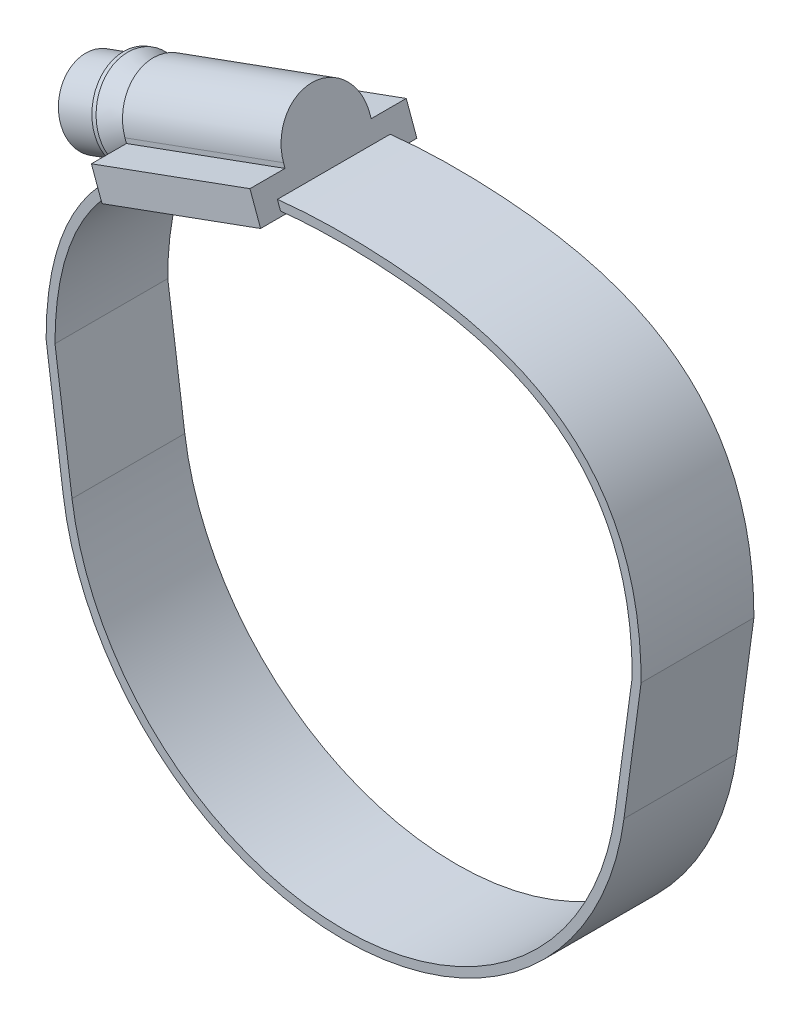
ISO-10303-21;
HEADER;
FILE_DESCRIPTION(('STEP AP214'),'2;1');
FILE_NAME('part.step','',(''),(''),'','','');
FILE_SCHEMA(('AUTOMOTIVE_DESIGN { 1 0 10303 214 1 1 1 1 }'));
ENDSEC;
DATA;
#1=APPLICATION_CONTEXT('core data for automotive mechanical design processes');
#2=APPLICATION_PROTOCOL_DEFINITION('international standard','automotive_design',2000,#1);
#3=PRODUCT_CONTEXT('',#1,'mechanical');
#4=PRODUCT('Part','Part','',(#3));
#5=PRODUCT_RELATED_PRODUCT_CATEGORY('part','',(#4));
#6=PRODUCT_DEFINITION_FORMATION('','',#4);
#7=PRODUCT_DEFINITION_CONTEXT('part definition',#1,'design');
#8=PRODUCT_DEFINITION('design','',#6,#7);
#9=PRODUCT_DEFINITION_SHAPE('','',#8);
#10=(LENGTH_UNIT() NAMED_UNIT(*) SI_UNIT(.MILLI.,.METRE.));
#11=(NAMED_UNIT(*) PLANE_ANGLE_UNIT() SI_UNIT($,.RADIAN.));
#12=(NAMED_UNIT(*) SI_UNIT($,.STERADIAN.) SOLID_ANGLE_UNIT());
#13=UNCERTAINTY_MEASURE_WITH_UNIT(LENGTH_MEASURE(1.E-05),#10,'distance_accuracy_value','');
#14=(GEOMETRIC_REPRESENTATION_CONTEXT(3) GLOBAL_UNCERTAINTY_ASSIGNED_CONTEXT((#13)) GLOBAL_UNIT_ASSIGNED_CONTEXT((#10,
#11,#12)) REPRESENTATION_CONTEXT('',''));
#15=CARTESIAN_POINT('',(0.,0.,0.));
#16=DIRECTION('',(0.,0.,1.));
#17=DIRECTION('',(1.,0.,0.));
#18=AXIS2_PLACEMENT_3D('',#15,#16,#17);
#19=CARTESIAN_POINT('',(-35.4411454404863,23.6717573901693,10.3));
#20=DIRECTION('',(-0.939692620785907,-0.342020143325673,0.));
#21=DIRECTION('',(0.342020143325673,-0.939692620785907,0.));
#22=AXIS2_PLACEMENT_3D('',#19,#20,#21);
#23=PLANE('',#22);
#24=CARTESIAN_POINT('',(-33.9704588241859,19.6310791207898,10.3));
#25=DIRECTION('',(0.939692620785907,0.342020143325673,0.));
#26=DIRECTION('',(-0.342020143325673,0.939692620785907,0.));
#27=AXIS2_PLACEMENT_3D('',#24,#25,#26);
#28=CIRCLE('',#27,4.29999999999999);
#29=CARTESIAN_POINT('',(-35.4411454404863,23.6717573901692,10.3));
#30=VERTEX_POINT('',#29);
#31=EDGE_CURVE('E24',#30,#30,#28,.T.);
#32=ORIENTED_EDGE('',*,*,#31,.F.);
#33=EDGE_LOOP('',(#32));
#34=FACE_BOUND('',#33,.T.);
#35=ADVANCED_FACE('F17',(#34),#23,.T.);
#36=CARTESIAN_POINT('',(-8.31685027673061,28.9682290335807,15.15));
#37=DIRECTION('',(0.,0.,1.));
#38=DIRECTION('',(1.,0.,0.));
#39=AXIS2_PLACEMENT_3D('',#36,#37,#38);
#40=PLANE('',#39);
#41=DIRECTION('',(-0.342020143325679,0.939692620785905,0.));
#42=VECTOR('',#41,1.);
#43=CARTESIAN_POINT('',(-8.14584020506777,28.4983827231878,15.15));
#44=LINE('',#43,#42);
#45=CARTESIAN_POINT('',(-8.14584020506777,28.4983827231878,15.15));
#46=VERTEX_POINT('',#45);
#47=CARTESIAN_POINT('',(-8.31685027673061,28.9682290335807,15.15));
#48=VERTEX_POINT('',#47);
#49=EDGE_CURVE('E292',#46,#48,#44,.T.);
#50=ORIENTED_EDGE('',*,*,#49,.T.);
#51=DIRECTION('',(-0.939692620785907,-0.342020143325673,0.));
#52=VECTOR('',#51,1.);
#53=CARTESIAN_POINT('',(-8.31685027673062,28.9682290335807,15.15));
#54=LINE('',#53,#52);
#55=CARTESIAN_POINT('',(-26.1710100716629,22.4698463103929,15.15));
#56=VERTEX_POINT('',#55);
#57=EDGE_CURVE('E274',#56,#48,#54,.F.);
#58=ORIENTED_EDGE('',*,*,#57,.F.);
#59=DIRECTION('',(0.342020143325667,-0.939692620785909,0.));
#60=VECTOR('',#59,1.);
#61=CARTESIAN_POINT('',(-26.1710100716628,22.4698463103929,15.15));
#62=LINE('',#61,#60);
#63=CARTESIAN_POINT('',(-26.,22.,15.15));
#64=VERTEX_POINT('',#63);
#65=EDGE_CURVE('E295',#56,#64,#62,.T.);
#66=ORIENTED_EDGE('',*,*,#65,.T.);
#67=DIRECTION('',(-0.939692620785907,-0.342020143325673,0.));
#68=VECTOR('',#67,1.);
#69=CARTESIAN_POINT('',(-8.14584020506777,28.4983827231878,15.15));
#70=LINE('',#69,#68);
#71=EDGE_CURVE('E280',#46,#64,#70,.T.);
#72=ORIENTED_EDGE('',*,*,#71,.F.);
#73=EDGE_LOOP('',(#50,#58,#66,#72));
#74=FACE_BOUND('',#73,.T.);
#75=ADVANCED_FACE('F490',(#74),#40,.T.);
#76=CARTESIAN_POINT('',(-8.14584020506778,28.4983827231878,5.45000000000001));
#77=DIRECTION('',(0.,0.,-1.));
#78=DIRECTION('',(0.,1.,0.));
#79=AXIS2_PLACEMENT_3D('',#76,#77,#78);
#80=PLANE('',#79);
#81=DIRECTION('',(0.342020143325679,-0.939692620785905,0.));
#82=VECTOR('',#81,1.);
#83=CARTESIAN_POINT('',(-8.31685027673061,28.9682290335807,5.45000000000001));
#84=LINE('',#83,#82);
#85=CARTESIAN_POINT('',(-8.31685027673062,28.9682290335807,5.45000000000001));
#86=VERTEX_POINT('',#85);
#87=CARTESIAN_POINT('',(-8.14584020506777,28.4983827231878,5.45000000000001));
#88=VERTEX_POINT('',#87);
#89=EDGE_CURVE('E285',#86,#88,#84,.T.);
#90=ORIENTED_EDGE('',*,*,#89,.T.);
#91=DIRECTION('',(-0.939692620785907,-0.342020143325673,0.));
#92=VECTOR('',#91,1.);
#93=CARTESIAN_POINT('',(-8.14584020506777,28.4983827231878,5.44999999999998));
#94=LINE('',#93,#92);
#95=CARTESIAN_POINT('',(-26.,22.,5.45));
#96=VERTEX_POINT('',#95);
#97=EDGE_CURVE('E270',#96,#88,#94,.F.);
#98=ORIENTED_EDGE('',*,*,#97,.F.);
#99=DIRECTION('',(-0.342020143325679,0.939692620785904,0.));
#100=VECTOR('',#99,1.);
#101=CARTESIAN_POINT('',(-26.,22.,5.45000000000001));
#102=LINE('',#101,#100);
#103=CARTESIAN_POINT('',(-26.1710100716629,22.4698463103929,5.45000000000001));
#104=VERTEX_POINT('',#103);
#105=EDGE_CURVE('E288',#96,#104,#102,.T.);
#106=ORIENTED_EDGE('',*,*,#105,.T.);
#107=DIRECTION('',(-0.939692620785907,-0.342020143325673,0.));
#108=VECTOR('',#107,1.);
#109=CARTESIAN_POINT('',(-8.31685027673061,28.9682290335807,5.45000000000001));
#110=LINE('',#109,#108);
#111=EDGE_CURVE('E271',#86,#104,#110,.T.);
#112=ORIENTED_EDGE('',*,*,#111,.F.);
#113=EDGE_LOOP('',(#90,#98,#106,#112));
#114=FACE_BOUND('',#113,.T.);
#115=ADVANCED_FACE('F488',(#114),#80,.T.);
#116=CARTESIAN_POINT('',(-8.31685027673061,28.9682290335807,10.3));
#117=DIRECTION('',(0.939692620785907,0.342020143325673,0.));
#118=DIRECTION('',(-0.342020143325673,0.939692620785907,0.));
#119=AXIS2_PLACEMENT_3D('',#116,#117,#118);
#120=CYLINDRICAL_SURFACE('',#119,4.29999999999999);
#121=CARTESIAN_POINT('',(-29.4599342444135,21.2727758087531,10.3));
#122=DIRECTION('',(0.939692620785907,0.342020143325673,0.));
#123=DIRECTION('',(-0.342020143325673,0.939692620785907,0.));
#124=AXIS2_PLACEMENT_3D('',#121,#122,#123);
#125=CIRCLE('',#124,4.29999999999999);
#126=CARTESIAN_POINT('',(-28.0078024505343,17.2830764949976,9.61910893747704));
#127=VERTEX_POINT('',#126);
#128=CARTESIAN_POINT('',(-28.0078024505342,17.2830764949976,10.9808910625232));
#129=VERTEX_POINT('',#128);
#130=EDGE_CURVE('E175',#127,#129,#125,.T.);
#131=ORIENTED_EDGE('',*,*,#130,.F.);
#132=CARTESIAN_POINT('',(-28.0078024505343,17.2830764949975,9.61910893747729));
#133=CARTESIAN_POINT('',(-28.0192975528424,17.2694002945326,9.67468365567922));
#134=CARTESIAN_POINT('',(-28.029433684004,17.2573087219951,9.73094082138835));
#135=CARTESIAN_POINT('',(-28.0468803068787,17.2364602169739,9.84451756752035));
#136=CARTESIAN_POINT('',(-28.0541899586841,17.227704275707,9.90183745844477));
#137=CARTESIAN_POINT('',(-28.0657276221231,17.2138702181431,10.0158075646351));
#138=CARTESIAN_POINT('',(-28.07002594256,17.2087082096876,10.0724404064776));
#139=CARTESIAN_POINT('',(-28.0757633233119,17.2018156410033,10.1860488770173));
#140=CARTESIAN_POINT('',(-28.077202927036,17.20008442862,10.2430244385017));
#141=CARTESIAN_POINT('',(-28.0772029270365,17.2000844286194,10.3569755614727));
#142=CARTESIAN_POINT('',(-28.0757633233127,17.2018156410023,10.4139511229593));
#143=CARTESIAN_POINT('',(-28.0700259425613,17.208708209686,10.5275595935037));
#144=CARTESIAN_POINT('',(-28.0657276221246,17.2138702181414,10.5841924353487));
#145=CARTESIAN_POINT('',(-28.0541899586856,17.2277042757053,10.6981625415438));
#146=CARTESIAN_POINT('',(-28.0468803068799,17.2364602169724,10.7554824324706));
#147=CARTESIAN_POINT('',(-28.0294336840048,17.2573087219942,10.8690591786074));
#148=CARTESIAN_POINT('',(-28.0192975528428,17.2694002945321,10.9253163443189));
#149=CARTESIAN_POINT('',(-28.0078024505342,17.2830764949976,10.9808910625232));
#150=B_SPLINE_CURVE_WITH_KNOTS('',3,(#132,#133,#134,#135,#136,#137,#138,#139,#140,#141,#142,
#143,#144,#145,#146,#147,#148,#149),.UNSPECIFIED.,.F.,.F.,(4,2,2,2,2,2,2,2,4),(0.,
0.175102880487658,0.350257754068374,0.521172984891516,0.692055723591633,0.86293846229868,
1.03385369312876,1.20900856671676,1.38411144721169),.UNSPECIFIED.);
#151=EDGE_CURVE('E162',#127,#129,#150,.T.);
#152=ORIENTED_EDGE('',*,*,#151,.T.);
#153=EDGE_LOOP('',(#131,#152));
#154=FACE_BOUND('',#153,.T.);
#155=ORIENTED_EDGE('',*,*,#31,.T.);
#156=EDGE_LOOP('',(#155));
#157=FACE_BOUND('',#156,.T.);
#158=ADVANCED_FACE('F176',(#154,#157),#120,.T.);
#159=CARTESIAN_POINT('',(-8.31685027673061,28.9682290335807,10.3));
#160=DIRECTION('',(0.939692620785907,0.342020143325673,0.));
#161=DIRECTION('',(-0.342020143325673,0.939692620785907,0.));
#162=AXIS2_PLACEMENT_3D('',#159,#160,#161);
#163=CYLINDRICAL_SURFACE('',#162,5.);
#164=CARTESIAN_POINT('',(-28.0078024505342,17.2830764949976,12.9407598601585));
#165=CARTESIAN_POINT('',(-27.9882527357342,17.3063325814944,12.9651450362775));
#166=CARTESIAN_POINT('',(-27.9684765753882,17.3297549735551,12.9891889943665));
#167=CARTESIAN_POINT('',(-27.9285045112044,17.3768829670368,13.036585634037));
#168=CARTESIAN_POINT('',(-27.908308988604,17.4005883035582,13.0599389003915));
#169=CARTESIAN_POINT('',(-27.8675054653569,17.4482637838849,13.1059784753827));
#170=CARTESIAN_POINT('',(-27.8468976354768,17.4722338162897,13.128665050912));
#171=CARTESIAN_POINT('',(-27.805276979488,17.5204205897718,13.1733928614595));
#172=CARTESIAN_POINT('',(-27.7842641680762,17.5446373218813,13.1954341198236));
#173=CARTESIAN_POINT('',(-27.7418374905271,17.5933037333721,13.238894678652));
#174=CARTESIAN_POINT('',(-27.7204234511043,17.6177535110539,13.260313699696));
#175=CARTESIAN_POINT('',(-27.6771986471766,17.6668722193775,13.3025504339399));
#176=CARTESIAN_POINT('',(-27.6553875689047,17.6915413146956,13.3233676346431));
#177=CARTESIAN_POINT('',(-27.633393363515,17.7162981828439,13.3438816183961));
#178=B_SPLINE_CURVE_WITH_KNOTS('',3,(#164,#165,#166,#167,#168,#169,#170,#171,#172,#173,#174,
#175,#176,#177),.UNSPECIFIED.,.F.,.F.,(4,2,2,2,2,2,4),(0.,0.11686851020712,0.233635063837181,
0.350354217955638,0.467069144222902,0.583835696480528,0.700698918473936),.UNSPECIFIED.);
#179=CARTESIAN_POINT('',(-28.0078024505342,17.2830764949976,12.9407598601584));
#180=VERTEX_POINT('',#179);
#181=CARTESIAN_POINT('',(-27.6333933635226,17.7162981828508,13.3438816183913));
#182=VERTEX_POINT('',#181);
#183=EDGE_CURVE('E474',#180,#182,#178,.T.);
#184=ORIENTED_EDGE('',*,*,#183,.T.);
#185=CARTESIAN_POINT('',(-28.9900879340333,21.4437858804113,10.3));
#186=DIRECTION('',(-0.939692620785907,-0.342020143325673,0.));
#187=DIRECTION('',(0.342020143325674,-0.939692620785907,0.));
#188=AXIS2_PLACEMENT_3D('',#185,#186,#187);
#189=CIRCLE('',#188,4.99999999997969);
#190=CARTESIAN_POINT('',(-27.6333933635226,17.7162981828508,7.25611838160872));
#191=VERTEX_POINT('',#190);
#192=EDGE_CURVE('E238',#191,#182,#189,.F.);
#193=ORIENTED_EDGE('',*,*,#192,.F.);
#194=CARTESIAN_POINT('',(-27.633393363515,17.7162981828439,7.2561183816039));
#195=CARTESIAN_POINT('',(-27.6553875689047,17.6915413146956,7.27663236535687));
#196=CARTESIAN_POINT('',(-27.6771986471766,17.6668722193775,7.29744956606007));
#197=CARTESIAN_POINT('',(-27.7204234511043,17.6177535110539,7.33968630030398));
#198=CARTESIAN_POINT('',(-27.7418374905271,17.5933037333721,7.36110532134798));
#199=CARTESIAN_POINT('',(-27.7842641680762,17.5446373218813,7.40456588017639));
#200=CARTESIAN_POINT('',(-27.805276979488,17.5204205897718,7.42660713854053));
#201=CARTESIAN_POINT('',(-27.8468976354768,17.4722338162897,7.47133494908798));
#202=CARTESIAN_POINT('',(-27.8675054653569,17.4482637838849,7.49402152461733));
#203=CARTESIAN_POINT('',(-27.908308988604,17.4005883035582,7.54006109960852));
#204=CARTESIAN_POINT('',(-27.9285045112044,17.3768829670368,7.56341436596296));
#205=CARTESIAN_POINT('',(-27.9684765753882,17.3297549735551,7.61081100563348));
#206=CARTESIAN_POINT('',(-27.9882527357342,17.3063325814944,7.63485496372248));
#207=CARTESIAN_POINT('',(-28.0078024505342,17.2830764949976,7.65924013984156));
#208=B_SPLINE_CURVE_WITH_KNOTS('',3,(#194,#195,#196,#197,#198,#199,#200,#201,#202,#203,#204,
#205,#206,#207),.UNSPECIFIED.,.F.,.F.,(4,2,2,2,2,2,4),(0.,0.116863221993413,0.23362977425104,
0.350344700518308,0.467063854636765,0.583830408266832,0.70069891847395),.UNSPECIFIED.);
#209=CARTESIAN_POINT('',(-28.0078024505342,17.2830764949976,7.65924013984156));
#210=VERTEX_POINT('',#209);
#211=EDGE_CURVE('E174',#191,#210,#208,.T.);
#212=ORIENTED_EDGE('',*,*,#211,.T.);
#213=CARTESIAN_POINT('',(-29.4599342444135,21.2727758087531,10.3));
#214=DIRECTION('',(0.939692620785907,0.342020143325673,0.));
#215=DIRECTION('',(-0.342020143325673,0.939692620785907,0.));
#216=AXIS2_PLACEMENT_3D('',#213,#214,#215);
#217=CIRCLE('',#216,5.);
#218=EDGE_CURVE('E180',#180,#210,#217,.F.);
#219=ORIENTED_EDGE('',*,*,#218,.F.);
#220=EDGE_LOOP('',(#184,#193,#212,#219));
#221=FACE_BOUND('',#220,.T.);
#222=ADVANCED_FACE('F457',(#221),#163,.T.);
#223=CARTESIAN_POINT('',(-8.31685027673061,28.9682290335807,10.3));
#224=DIRECTION('',(0.939692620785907,0.342020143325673,0.));
#225=DIRECTION('',(-0.342020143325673,0.939692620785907,0.));
#226=AXIS2_PLACEMENT_3D('',#223,#224,#225);
#227=CYLINDRICAL_SURFACE('',#226,3.74999999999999);
#228=CARTESIAN_POINT('',(-26.1710100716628,22.4698463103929,10.3));
#229=DIRECTION('',(0.939692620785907,0.342020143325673,0.));
#230=DIRECTION('',(-0.342020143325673,0.939692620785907,0.));
#231=AXIS2_PLACEMENT_3D('',#228,#229,#230);
#232=CIRCLE('',#231,3.74999999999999);
#233=CARTESIAN_POINT('',(-25.2702543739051,19.9950403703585,7.63045420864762));
#234=VERTEX_POINT('',#233);
#235=CARTESIAN_POINT('',(-25.2702543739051,19.9950403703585,12.9695457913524));
#236=VERTEX_POINT('',#235);
#237=EDGE_CURVE('E234',#234,#236,#232,.T.);
#238=ORIENTED_EDGE('',*,*,#237,.F.);
#239=CARTESIAN_POINT('',(-25.2702543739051,19.9950403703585,7.63045420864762));
#240=CARTESIAN_POINT('',(-25.3174533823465,19.955959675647,7.65076031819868));
#241=CARTESIAN_POINT('',(-25.3643312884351,19.9168156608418,7.67169897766));
#242=CARTESIAN_POINT('',(-25.4573311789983,19.8385100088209,7.71490246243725));
#243=CARTESIAN_POINT('',(-25.5034541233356,19.7993484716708,7.73716540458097));
#244=CARTESIAN_POINT('',(-25.5949253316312,19.7210391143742,7.78311612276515));
#245=CARTESIAN_POINT('',(-25.6402741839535,19.6818913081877,7.80680274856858));
#246=CARTESIAN_POINT('',(-25.7301834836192,19.603638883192,7.85571978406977));
#247=CARTESIAN_POINT('',(-25.7747438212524,19.5645342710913,7.880950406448));
#248=CARTESIAN_POINT('',(-25.8630340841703,19.4864234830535,7.93307576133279));
#249=CARTESIAN_POINT('',(-25.9067634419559,19.4474173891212,7.9599715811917));
#250=CARTESIAN_POINT('',(-25.993350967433,19.3695623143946,8.01557225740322));
#251=CARTESIAN_POINT('',(-26.0362076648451,19.3307136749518,8.04427987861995));
#252=CARTESIAN_POINT('',(-26.0785541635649,19.2920213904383,8.07393156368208));
#253=B_SPLINE_CURVE_WITH_KNOTS('',3,(#239,#240,#241,#242,#243,#244,#245,#246,#247,#248,#249,
#250,#251,#252),.UNSPECIFIED.,.F.,.F.,(4,2,2,2,2,2,4),(0.,0.193665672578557,0.387062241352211,
0.580304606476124,0.77357365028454,0.966970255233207,1.16066948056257),.UNSPECIFIED.);
#254=CARTESIAN_POINT('',(-26.0785541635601,19.2920213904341,8.07393156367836));
#255=VERTEX_POINT('',#254);
#256=EDGE_CURVE('E284',#234,#255,#253,.T.);
#257=ORIENTED_EDGE('',*,*,#256,.T.);
#258=CARTESIAN_POINT('',(-27.1107026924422,22.1278261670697,10.3));
#259=DIRECTION('',(-0.939692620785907,-0.342020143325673,0.));
#260=DIRECTION('',(0.342020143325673,-0.939692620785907,0.));
#261=AXIS2_PLACEMENT_3D('',#258,#259,#260);
#262=CIRCLE('',#261,3.75000000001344);
#263=CARTESIAN_POINT('',(-26.0785541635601,19.292021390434,12.5260684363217));
#264=VERTEX_POINT('',#263);
#265=EDGE_CURVE('E179',#264,#255,#262,.T.);
#266=ORIENTED_EDGE('',*,*,#265,.F.);
#267=CARTESIAN_POINT('',(-26.0785541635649,19.2920213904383,12.5260684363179));
#268=CARTESIAN_POINT('',(-26.0362076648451,19.3307136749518,12.5557201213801));
#269=CARTESIAN_POINT('',(-25.993350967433,19.3695623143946,12.5844277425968));
#270=CARTESIAN_POINT('',(-25.9067634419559,19.4474173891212,12.6400284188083));
#271=CARTESIAN_POINT('',(-25.8630340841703,19.4864234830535,12.6669242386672));
#272=CARTESIAN_POINT('',(-25.7747438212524,19.5645342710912,12.719049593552));
#273=CARTESIAN_POINT('',(-25.7301834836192,19.603638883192,12.7442802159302));
#274=CARTESIAN_POINT('',(-25.6402741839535,19.6818913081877,12.7931972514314));
#275=CARTESIAN_POINT('',(-25.5949253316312,19.7210391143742,12.8168838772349));
#276=CARTESIAN_POINT('',(-25.5034541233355,19.7993484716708,12.862834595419));
#277=CARTESIAN_POINT('',(-25.4573311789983,19.8385100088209,12.8850975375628));
#278=CARTESIAN_POINT('',(-25.3643312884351,19.9168156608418,12.92830102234));
#279=CARTESIAN_POINT('',(-25.3174533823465,19.955959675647,12.9492396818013));
#280=CARTESIAN_POINT('',(-25.2702543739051,19.9950403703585,12.9695457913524));
#281=B_SPLINE_CURVE_WITH_KNOTS('',3,(#267,#268,#269,#270,#271,#272,#273,#274,#275,#276,#277,
#278,#279,#280),.UNSPECIFIED.,.F.,.F.,(4,2,2,2,2,2,4),(0.,0.193699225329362,0.387095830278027,
0.580364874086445,0.773607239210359,0.967003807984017,1.16066948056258),.UNSPECIFIED.);
#282=EDGE_CURVE('E468',#264,#236,#281,.T.);
#283=ORIENTED_EDGE('',*,*,#282,.T.);
#284=EDGE_LOOP('',(#238,#257,#266,#283));
#285=FACE_BOUND('',#284,.T.);
#286=ADVANCED_FACE('F452',(#285),#227,.T.);
#287=CARTESIAN_POINT('',(-24.8029294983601,18.7110758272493,1.5));
#288=DIRECTION('',(0.342020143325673,-0.939692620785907,0.));
#289=DIRECTION('',(0.939692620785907,0.342020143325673,0.));
#290=AXIS2_PLACEMENT_3D('',#287,#288,#289);
#291=PLANE('',#290);
#292=DIRECTION('',(0.,0.,1.));
#293=VECTOR('',#292,1.);
#294=CARTESIAN_POINT('',(-24.8029294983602,18.7110758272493,1.5));
#295=LINE('',#294,#293);
#296=CARTESIAN_POINT('',(-24.8029294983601,18.7110758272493,1.5));
#297=VERTEX_POINT('',#296);
#298=CARTESIAN_POINT('',(-24.8029294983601,18.7110758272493,19.1));
#299=VERTEX_POINT('',#298);
#300=EDGE_CURVE('E231',#297,#299,#295,.T.);
#301=ORIENTED_EDGE('',*,*,#300,.F.);
#302=DIRECTION('',(0.939692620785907,0.342020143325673,0.));
#303=VECTOR('',#302,1.);
#304=CARTESIAN_POINT('',(-24.8029294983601,18.7110758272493,1.5));
#305=LINE('',#304,#303);
#306=CARTESIAN_POINT('',(-6.94876970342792,25.2094585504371,1.5));
#307=VERTEX_POINT('',#306);
#308=EDGE_CURVE('E267',#297,#307,#305,.T.);
#309=ORIENTED_EDGE('',*,*,#308,.T.);
#310=DIRECTION('',(0.,0.,1.));
#311=VECTOR('',#310,1.);
#312=CARTESIAN_POINT('',(-6.94876970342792,25.2094585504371,1.5));
#313=LINE('',#312,#311);
#314=CARTESIAN_POINT('',(-6.94876970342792,25.2094585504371,19.1));
#315=VERTEX_POINT('',#314);
#316=EDGE_CURVE('E253',#315,#307,#313,.F.);
#317=ORIENTED_EDGE('',*,*,#316,.F.);
#318=DIRECTION('',(0.939692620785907,0.342020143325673,0.));
#319=VECTOR('',#318,1.);
#320=CARTESIAN_POINT('',(-24.8029294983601,18.7110758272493,19.1));
#321=LINE('',#320,#319);
#322=EDGE_CURVE('E281',#299,#315,#321,.T.);
#323=ORIENTED_EDGE('',*,*,#322,.F.);
#324=EDGE_LOOP('',(#301,#309,#317,#323));
#325=FACE_BOUND('',#324,.T.);
#326=ADVANCED_FACE('F448',(#325),#291,.T.);
#327=CARTESIAN_POINT('',(-26.,22.,19.1));
#328=DIRECTION('',(0.,0.,1.));
#329=DIRECTION('',(1.,0.,0.));
#330=AXIS2_PLACEMENT_3D('',#327,#328,#329);
#331=PLANE('',#330);
#332=ORIENTED_EDGE('',*,*,#322,.T.);
#333=DIRECTION('',(-0.342020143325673,0.939692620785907,0.));
#334=VECTOR('',#333,1.);
#335=CARTESIAN_POINT('',(-6.94876970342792,25.2094585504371,19.1));
#336=LINE('',#335,#334);
#337=CARTESIAN_POINT('',(-8.14584020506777,28.4983827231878,19.1));
#338=VERTEX_POINT('',#337);
#339=EDGE_CURVE('E256',#338,#315,#336,.F.);
#340=ORIENTED_EDGE('',*,*,#339,.F.);
#341=DIRECTION('',(-0.939692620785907,-0.342020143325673,0.));
#342=VECTOR('',#341,1.);
#343=CARTESIAN_POINT('',(-8.14584020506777,28.4983827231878,19.1));
#344=LINE('',#343,#342);
#345=CARTESIAN_POINT('',(-26.,22.,19.1));
#346=VERTEX_POINT('',#345);
#347=EDGE_CURVE('E277',#346,#338,#344,.F.);
#348=ORIENTED_EDGE('',*,*,#347,.F.);
#349=DIRECTION('',(0.342020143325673,-0.939692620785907,0.));
#350=VECTOR('',#349,1.);
#351=CARTESIAN_POINT('',(-26.,22.,19.1));
#352=LINE('',#351,#350);
#353=EDGE_CURVE('E227',#299,#346,#352,.F.);
#354=ORIENTED_EDGE('',*,*,#353,.F.);
#355=EDGE_LOOP('',(#332,#340,#348,#354));
#356=FACE_BOUND('',#355,.T.);
#357=ADVANCED_FACE('F444',(#356),#331,.T.);
#358=CARTESIAN_POINT('',(-8.14584020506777,28.4983827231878,1.5));
#359=DIRECTION('',(-0.342020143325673,0.939692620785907,0.));
#360=DIRECTION('',(-0.939692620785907,-0.342020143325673,0.));
#361=AXIS2_PLACEMENT_3D('',#358,#359,#360);
#362=PLANE('',#361);
#363=ORIENTED_EDGE('',*,*,#347,.T.);
#364=DIRECTION('',(0.,0.,1.));
#365=VECTOR('',#364,1.);
#366=CARTESIAN_POINT('',(-8.14584020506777,28.4983827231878,1.5));
#367=LINE('',#366,#365);
#368=EDGE_CURVE('E259',#46,#338,#367,.T.);
#369=ORIENTED_EDGE('',*,*,#368,.F.);
#370=ORIENTED_EDGE('',*,*,#71,.T.);
#371=DIRECTION('',(0.,0.,1.));
#372=VECTOR('',#371,1.);
#373=CARTESIAN_POINT('',(-26.,22.,1.5));
#374=LINE('',#373,#372);
#375=EDGE_CURVE('E230',#346,#64,#374,.F.);
#376=ORIENTED_EDGE('',*,*,#375,.F.);
#377=EDGE_LOOP('',(#363,#369,#370,#376));
#378=FACE_BOUND('',#377,.T.);
#379=ADVANCED_FACE('F440',(#378),#362,.T.);
#380=CARTESIAN_POINT('',(-8.31685027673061,28.9682290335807,10.3));
#381=DIRECTION('',(-0.939692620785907,-0.342020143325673,0.));
#382=DIRECTION('',(0.342020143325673,-0.939692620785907,0.));
#383=AXIS2_PLACEMENT_3D('',#380,#381,#382);
#384=CYLINDRICAL_SURFACE('',#383,4.85);
#385=CARTESIAN_POINT('',(-8.31685027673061,28.9682290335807,10.3));
#386=DIRECTION('',(-0.939692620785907,-0.342020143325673,0.));
#387=DIRECTION('',(0.342020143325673,-0.939692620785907,0.));
#388=AXIS2_PLACEMENT_3D('',#385,#386,#387);
#389=CIRCLE('',#388,4.85);
#390=EDGE_CURVE('E309',#86,#48,#389,.F.);
#391=ORIENTED_EDGE('',*,*,#390,.F.);
#392=ORIENTED_EDGE('',*,*,#111,.T.);
#393=CARTESIAN_POINT('',(-26.1710100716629,22.4698463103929,10.3));
#394=DIRECTION('',(-0.939692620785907,-0.342020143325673,0.));
#395=DIRECTION('',(0.342020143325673,-0.939692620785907,0.));
#396=AXIS2_PLACEMENT_3D('',#393,#394,#395);
#397=CIRCLE('',#396,4.85);
#398=EDGE_CURVE('E314',#56,#104,#397,.T.);
#399=ORIENTED_EDGE('',*,*,#398,.F.);
#400=ORIENTED_EDGE('',*,*,#57,.T.);
#401=EDGE_LOOP('',(#391,#392,#399,#400));
#402=FACE_BOUND('',#401,.T.);
#403=ADVANCED_FACE('F436',(#402),#384,.T.);
#404=CARTESIAN_POINT('',(-8.14584020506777,28.4983827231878,1.5));
#405=DIRECTION('',(-0.342020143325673,0.939692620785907,0.));
#406=DIRECTION('',(-0.939692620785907,-0.342020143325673,0.));
#407=AXIS2_PLACEMENT_3D('',#404,#405,#406);
#408=PLANE('',#407);
#409=DIRECTION('',(-0.939692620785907,-0.342020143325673,0.));
#410=VECTOR('',#409,1.);
#411=CARTESIAN_POINT('',(-8.14584020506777,28.4983827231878,1.5));
#412=LINE('',#411,#410);
#413=CARTESIAN_POINT('',(-8.14584020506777,28.4983827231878,1.5));
#414=VERTEX_POINT('',#413);
#415=CARTESIAN_POINT('',(-26.,22.,1.5));
#416=VERTEX_POINT('',#415);
#417=EDGE_CURVE('E263',#414,#416,#412,.T.);
#418=ORIENTED_EDGE('',*,*,#417,.T.);
#419=DIRECTION('',(0.,0.,1.));
#420=VECTOR('',#419,1.);
#421=CARTESIAN_POINT('',(-26.,22.,1.5));
#422=LINE('',#421,#420);
#423=EDGE_CURVE('E226',#96,#416,#422,.F.);
#424=ORIENTED_EDGE('',*,*,#423,.F.);
#425=ORIENTED_EDGE('',*,*,#97,.T.);
#426=DIRECTION('',(0.,0.,1.));
#427=VECTOR('',#426,1.);
#428=CARTESIAN_POINT('',(-8.14584020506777,28.4983827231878,1.5));
#429=LINE('',#428,#427);
#430=EDGE_CURVE('E266',#414,#88,#429,.T.);
#431=ORIENTED_EDGE('',*,*,#430,.F.);
#432=EDGE_LOOP('',(#418,#424,#425,#431));
#433=FACE_BOUND('',#432,.T.);
#434=ADVANCED_FACE('F432',(#433),#408,.T.);
#435=CARTESIAN_POINT('',(-26.,22.,1.5));
#436=DIRECTION('',(0.,0.,1.));
#437=DIRECTION('',(1.,0.,0.));
#438=AXIS2_PLACEMENT_3D('',#435,#436,#437);
#439=PLANE('',#438);
#440=DIRECTION('',(-0.342020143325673,0.939692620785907,0.));
#441=VECTOR('',#440,1.);
#442=CARTESIAN_POINT('',(-6.94876970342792,25.2094585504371,1.5));
#443=LINE('',#442,#441);
#444=EDGE_CURVE('E249',#307,#414,#443,.T.);
#445=ORIENTED_EDGE('',*,*,#444,.F.);
#446=ORIENTED_EDGE('',*,*,#308,.F.);
#447=DIRECTION('',(0.342020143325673,-0.939692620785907,0.));
#448=VECTOR('',#447,1.);
#449=CARTESIAN_POINT('',(-26.,22.,1.5));
#450=LINE('',#449,#448);
#451=EDGE_CURVE('E223',#416,#297,#450,.T.);
#452=ORIENTED_EDGE('',*,*,#451,.F.);
#453=ORIENTED_EDGE('',*,*,#417,.F.);
#454=EDGE_LOOP('',(#445,#446,#452,#453));
#455=FACE_BOUND('',#454,.T.);
#456=ADVANCED_FACE('F427',(#455),#439,.F.);
#457=CARTESIAN_POINT('',(-8.31685027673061,28.9682290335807,10.3));
#458=DIRECTION('',(0.939692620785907,0.342020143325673,0.));
#459=DIRECTION('',(-0.342020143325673,0.939692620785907,0.));
#460=AXIS2_PLACEMENT_3D('',#457,#458,#459);
#461=CYLINDRICAL_SURFACE('',#460,3.74999999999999);
#462=CARTESIAN_POINT('',(-26.1710100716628,22.4698463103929,10.3));
#463=DIRECTION('',(0.939692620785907,0.342020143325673,0.));
#464=DIRECTION('',(-0.342020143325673,0.939692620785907,0.));
#465=AXIS2_PLACEMENT_3D('',#462,#463,#464);
#466=CIRCLE('',#465,3.74999999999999);
#467=CARTESIAN_POINT('',(-24.9060807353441,18.9944815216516,10.9199139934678));
#468=VERTEX_POINT('',#467);
#469=CARTESIAN_POINT('',(-24.9060807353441,18.9944815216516,9.68008600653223));
#470=VERTEX_POINT('',#469);
#471=EDGE_CURVE('E237',#468,#470,#466,.T.);
#472=ORIENTED_EDGE('',*,*,#471,.F.);
#473=CARTESIAN_POINT('',(-24.9060807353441,18.9944815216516,9.68008600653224));
#474=CARTESIAN_POINT('',(-24.919296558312,18.9831561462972,9.71659503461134));
#475=CARTESIAN_POINT('',(-24.9314809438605,18.9726867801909,9.75375901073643));
#476=CARTESIAN_POINT('',(-24.9536064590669,18.9536390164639,9.82925598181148));
#477=CARTESIAN_POINT('',(-24.9635456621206,18.9450622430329,9.86758994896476));
#478=CARTESIAN_POINT('',(-24.9809608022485,18.9300127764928,9.94515005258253));
#479=CARTESIAN_POINT('',(-24.9884413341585,18.9235361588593,9.98437437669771));
#480=CARTESIAN_POINT('',(-25.0008102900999,18.9128167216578,10.0635083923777));
#481=CARTESIAN_POINT('',(-25.0056995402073,18.9085731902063,10.1034178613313));
#482=CARTESIAN_POINT('',(-25.0163312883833,18.8993434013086,10.224222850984));
#483=CARTESIAN_POINT('',(-25.0179544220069,18.8979302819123,10.3058306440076));
#484=CARTESIAN_POINT('',(-25.0100316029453,18.9048128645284,10.4680094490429));
#485=CARTESIAN_POINT('',(-25.0004910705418,18.9131038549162,10.5485809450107));
#486=CARTESIAN_POINT('',(-24.9764635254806,18.9339027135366,10.6778689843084));
#487=CARTESIAN_POINT('',(-24.9649927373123,18.9438188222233,10.7276133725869));
#488=CARTESIAN_POINT('',(-24.9382715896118,18.9668493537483,10.8252330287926));
#489=CARTESIAN_POINT('',(-24.9230272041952,18.9799587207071,10.873111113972));
#490=CARTESIAN_POINT('',(-24.9060807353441,18.9944815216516,10.9199139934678));
#491=B_SPLINE_CURVE_WITH_KNOTS('',3,(#473,#474,#475,#476,#477,#478,#479,#480,#481,#482,#483,
#484,#485,#486,#487,#488,#489,#490),.UNSPECIFIED.,.F.,.F.,(4,2,2,2,2,2,2,2,4),(0.,
0.121329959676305,0.242763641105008,0.363969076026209,0.485135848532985,0.728595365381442,
0.971936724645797,1.12769499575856,1.28320824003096),.UNSPECIFIED.);
#492=EDGE_CURVE('E218',#470,#468,#491,.T.);
#493=ORIENTED_EDGE('',*,*,#492,.F.);
#494=EDGE_LOOP('',(#472,#493));
#495=FACE_BOUND('',#494,.T.);
#496=ADVANCED_FACE('F421',(#495),#461,.T.);
#497=CARTESIAN_POINT('',(-6.94876970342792,25.2094585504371,1.5));
#498=DIRECTION('',(0.939692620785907,0.342020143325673,0.));
#499=DIRECTION('',(-0.342020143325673,0.939692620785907,0.));
#500=AXIS2_PLACEMENT_3D('',#497,#498,#499);
#501=PLANE('',#500);
#502=DIRECTION('',(0.,0.,-1.));
#503=VECTOR('',#502,1.);
#504=CARTESIAN_POINT('',(-7.10394182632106,25.6357904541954,10.35));
#505=LINE('',#504,#503);
#506=CARTESIAN_POINT('',(-7.10394182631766,25.6357904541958,16.7));
#507=VERTEX_POINT('',#506);
#508=CARTESIAN_POINT('',(-7.10394182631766,25.6357904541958,4.));
#509=VERTEX_POINT('',#508);
#510=EDGE_CURVE('E201',#507,#509,#505,.T.);
#511=ORIENTED_EDGE('',*,*,#510,.F.);
#512=DIRECTION('',(-0.342020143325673,0.939692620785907,0.));
#513=VECTOR('',#512,1.);
#514=CARTESIAN_POINT('',(-6.94876970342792,25.2094585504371,16.7));
#515=LINE('',#514,#513);
#516=CARTESIAN_POINT('',(-7.45604156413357,26.6031765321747,16.7));
#517=VERTEX_POINT('',#516);
#518=EDGE_CURVE('E260',#507,#517,#515,.T.);
#519=ORIENTED_EDGE('',*,*,#518,.T.);
#520=DIRECTION('',(0.,0.,-1.));
#521=VECTOR('',#520,1.);
#522=CARTESIAN_POINT('',(-7.45604156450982,26.6031765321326,10.35));
#523=LINE('',#522,#521);
#524=CARTESIAN_POINT('',(-7.45604156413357,26.6031765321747,4.));
#525=VERTEX_POINT('',#524);
#526=EDGE_CURVE('E195',#517,#525,#523,.T.);
#527=ORIENTED_EDGE('',*,*,#526,.T.);
#528=DIRECTION('',(-0.342020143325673,0.939692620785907,0.));
#529=VECTOR('',#528,1.);
#530=CARTESIAN_POINT('',(-6.94876970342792,25.2094585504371,4.));
#531=LINE('',#530,#529);
#532=EDGE_CURVE('E252',#525,#509,#531,.F.);
#533=ORIENTED_EDGE('',*,*,#532,.T.);
#534=EDGE_LOOP('',(#511,#519,#527,#533));
#535=FACE_BOUND('',#534,.T.);
#536=ORIENTED_EDGE('',*,*,#316,.T.);
#537=ORIENTED_EDGE('',*,*,#444,.T.);
#538=ORIENTED_EDGE('',*,*,#430,.T.);
#539=ORIENTED_EDGE('',*,*,#89,.F.);
#540=ORIENTED_EDGE('',*,*,#390,.T.);
#541=ORIENTED_EDGE('',*,*,#49,.F.);
#542=ORIENTED_EDGE('',*,*,#368,.T.);
#543=ORIENTED_EDGE('',*,*,#339,.T.);
#544=EDGE_LOOP('',(#536,#537,#538,#539,#540,#541,#542,#543));
#545=FACE_BOUND('',#544,.T.);
#546=ADVANCED_FACE('F426',(#535,#545),#501,.T.);
#547=CARTESIAN_POINT('',(-31.1700349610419,25.9712389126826,10.3));
#548=DIRECTION('',(-0.939692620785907,-0.342020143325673,0.));
#549=DIRECTION('',(0.342020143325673,-0.939692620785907,0.));
#550=AXIS2_PLACEMENT_3D('',#547,#548,#549);
#551=PLANE('',#550);
#552=DIRECTION('',(0.,0.,1.));
#553=VECTOR('',#552,1.);
#554=CARTESIAN_POINT('',(-28.0078024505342,17.2830764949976,10.35));
#555=LINE('',#554,#553);
#556=EDGE_CURVE('E170',#210,#127,#555,.T.);
#557=ORIENTED_EDGE('',*,*,#556,.T.);
#558=ORIENTED_EDGE('',*,*,#130,.T.);
#559=DIRECTION('',(0.,0.,1.));
#560=VECTOR('',#559,1.);
#561=CARTESIAN_POINT('',(-28.0078024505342,17.2830764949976,10.35));
#562=LINE('',#561,#560);
#563=EDGE_CURVE('E173',#129,#180,#562,.T.);
#564=ORIENTED_EDGE('',*,*,#563,.T.);
#565=ORIENTED_EDGE('',*,*,#218,.T.);
#566=EDGE_LOOP('',(#557,#558,#564,#565));
#567=FACE_BOUND('',#566,.T.);
#568=ADVANCED_FACE('F183',(#567),#551,.T.);
#569=CARTESIAN_POINT('',(-28.9900879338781,21.4437858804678,10.3));
#570=DIRECTION('',(-0.939692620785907,-0.342020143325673,0.));
#571=DIRECTION('',(0.342020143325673,-0.939692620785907,0.));
#572=AXIS2_PLACEMENT_3D('',#569,#570,#571);
#573=CONICAL_SURFACE('',#572,4.99999999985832,0.55859931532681);
#574=CARTESIAN_POINT('',(-26.0785541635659,19.2920213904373,8.07393156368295));
#575=CARTESIAN_POINT('',(-26.1447990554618,19.2314949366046,8.03299101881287));
#576=CARTESIAN_POINT('',(-26.2109515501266,19.170298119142,7.99289268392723));
#577=CARTESIAN_POINT('',(-26.3429116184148,19.046668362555,7.91442761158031));
#578=CARTESIAN_POINT('',(-26.408719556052,18.9842373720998,7.8760584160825));
#579=CARTESIAN_POINT('',(-26.539959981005,18.8581288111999,7.80101597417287));
#580=CARTESIAN_POINT('',(-26.6053927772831,18.7944525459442,7.76434107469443));
#581=CARTESIAN_POINT('',(-26.7358619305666,18.6658345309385,7.6926815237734));
#582=CARTESIAN_POINT('',(-26.8008984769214,18.6008934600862,7.6576959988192));
#583=CARTESIAN_POINT('',(-26.9305646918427,18.4697153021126,7.58942428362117));
#584=CARTESIAN_POINT('',(-26.9951943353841,18.403478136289,7.55613819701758));
#585=CARTESIAN_POINT('',(-27.1240276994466,18.269684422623,7.49129982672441));
#586=CARTESIAN_POINT('',(-27.1882312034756,18.202127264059,7.45974837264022));
#587=CARTESIAN_POINT('',(-27.3162008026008,18.0656608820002,7.39842644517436));
#588=CARTESIAN_POINT('',(-27.3799664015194,17.9967503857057,7.36865776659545));
#589=CARTESIAN_POINT('',(-27.507051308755,17.857540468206,7.31096768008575));
#590=CARTESIAN_POINT('',(-27.5703697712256,17.7872390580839,7.28304920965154));
#591=CARTESIAN_POINT('',(-27.6333933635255,17.7162981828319,7.25611838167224));
#592=B_SPLINE_CURVE_WITH_KNOTS('',3,(#574,#575,#576,#577,#578,#579,#580,#581,#582,#583,#584,
#585,#586,#587,#588,#589,#590,#591),.UNSPECIFIED.,.F.,.F.,(4,2,2,2,2,2,2,2,4),(0.,
0.295885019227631,0.5913352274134,0.886490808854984,1.1814921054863,1.47651137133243,
1.7716705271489,2.06712200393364,2.36303184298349),.UNSPECIFIED.);
#593=EDGE_CURVE('E184',#255,#191,#592,.T.);
#594=ORIENTED_EDGE('',*,*,#593,.T.);
#595=ORIENTED_EDGE('',*,*,#192,.T.);
#596=CARTESIAN_POINT('',(-27.6333933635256,17.7162981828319,13.3438816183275));
#597=CARTESIAN_POINT('',(-27.5703697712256,17.7872390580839,13.3169507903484));
#598=CARTESIAN_POINT('',(-27.507051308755,17.857540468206,13.2890323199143));
#599=CARTESIAN_POINT('',(-27.3799664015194,17.9967503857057,13.2313422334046));
#600=CARTESIAN_POINT('',(-27.3162008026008,18.0656608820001,13.2015735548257));
#601=CARTESIAN_POINT('',(-27.1882312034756,18.202127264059,13.1402516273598));
#602=CARTESIAN_POINT('',(-27.1240276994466,18.269684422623,13.1087001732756));
#603=CARTESIAN_POINT('',(-26.9951943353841,18.4034781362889,13.0438618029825));
#604=CARTESIAN_POINT('',(-26.9305646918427,18.4697153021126,13.0105757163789));
#605=CARTESIAN_POINT('',(-26.8008984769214,18.6008934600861,12.9423040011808));
#606=CARTESIAN_POINT('',(-26.7358619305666,18.6658345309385,12.9073184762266));
#607=CARTESIAN_POINT('',(-26.6053927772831,18.7944525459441,12.8356589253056));
#608=CARTESIAN_POINT('',(-26.539959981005,18.8581288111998,12.7989840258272));
#609=CARTESIAN_POINT('',(-26.4087195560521,18.9842373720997,12.7239415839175));
#610=CARTESIAN_POINT('',(-26.342911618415,19.0466683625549,12.6855723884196));
#611=CARTESIAN_POINT('',(-26.2109515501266,19.170298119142,12.6071073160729));
#612=CARTESIAN_POINT('',(-26.1447990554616,19.2314949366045,12.5670089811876));
#613=CARTESIAN_POINT('',(-26.0785541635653,19.2920213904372,12.5260684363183));
#614=B_SPLINE_CURVE_WITH_KNOTS('',3,(#596,#597,#598,#599,#600,#601,#602,#603,#604,#605,#606,
#607,#608,#609,#610,#611,#612,#613),.UNSPECIFIED.,.F.,.F.,(4,2,2,2,2,2,2,2,4),(0.,
0.295909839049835,0.591361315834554,0.886520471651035,1.18153973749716,1.47654103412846,
1.77169661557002,2.06714682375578,2.36303184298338),.UNSPECIFIED.);
#615=EDGE_CURVE('E186',#182,#264,#614,.T.);
#616=ORIENTED_EDGE('',*,*,#615,.T.);
#617=ORIENTED_EDGE('',*,*,#265,.T.);
#618=EDGE_LOOP('',(#594,#595,#616,#617));
#619=FACE_BOUND('',#618,.T.);
#620=ADVANCED_FACE('F546',(#619),#573,.T.);
#621=CARTESIAN_POINT('',(-26.,22.,1.5));
#622=DIRECTION('',(-0.939692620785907,-0.342020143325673,0.));
#623=DIRECTION('',(0.342020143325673,-0.939692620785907,0.));
#624=AXIS2_PLACEMENT_3D('',#621,#622,#623);
#625=PLANE('',#624);
#626=ORIENTED_EDGE('',*,*,#423,.T.);
#627=ORIENTED_EDGE('',*,*,#451,.T.);
#628=ORIENTED_EDGE('',*,*,#300,.T.);
#629=ORIENTED_EDGE('',*,*,#353,.T.);
#630=ORIENTED_EDGE('',*,*,#375,.T.);
#631=ORIENTED_EDGE('',*,*,#65,.F.);
#632=ORIENTED_EDGE('',*,*,#398,.T.);
#633=ORIENTED_EDGE('',*,*,#105,.F.);
#634=EDGE_LOOP('',(#626,#627,#628,#629,#630,#631,#632,#633));
#635=FACE_BOUND('',#634,.T.);
#636=DIRECTION('',(0.,0.,1.));
#637=VECTOR('',#636,1.);
#638=CARTESIAN_POINT('',(-25.2702543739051,19.9950403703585,10.35));
#639=LINE('',#638,#637);
#640=CARTESIAN_POINT('',(-25.2702543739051,19.9950403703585,4.));
#641=VERTEX_POINT('',#640);
#642=EDGE_CURVE('E189',#641,#234,#639,.T.);
#643=ORIENTED_EDGE('',*,*,#642,.T.);
#644=ORIENTED_EDGE('',*,*,#237,.T.);
#645=DIRECTION('',(0.,0.,1.));
#646=VECTOR('',#645,1.);
#647=CARTESIAN_POINT('',(-25.2702543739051,19.9950403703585,10.35));
#648=LINE('',#647,#646);
#649=CARTESIAN_POINT('',(-25.2702543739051,19.9950403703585,16.7));
#650=VERTEX_POINT('',#649);
#651=EDGE_CURVE('E529',#236,#650,#648,.T.);
#652=ORIENTED_EDGE('',*,*,#651,.T.);
#653=DIRECTION('',(0.342020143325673,-0.939692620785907,0.));
#654=VECTOR('',#653,1.);
#655=CARTESIAN_POINT('',(-26.,22.,16.7));
#656=LINE('',#655,#654);
#657=CARTESIAN_POINT('',(-24.9060807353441,18.9944815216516,16.7));
#658=VERTEX_POINT('',#657);
#659=EDGE_CURVE('E235',#650,#658,#656,.T.);
#660=ORIENTED_EDGE('',*,*,#659,.T.);
#661=DIRECTION('',(0.,0.,1.));
#662=VECTOR('',#661,1.);
#663=CARTESIAN_POINT('',(-24.9060807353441,18.9944815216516,10.35));
#664=LINE('',#663,#662);
#665=EDGE_CURVE('E215',#468,#658,#664,.T.);
#666=ORIENTED_EDGE('',*,*,#665,.F.);
#667=ORIENTED_EDGE('',*,*,#471,.T.);
#668=DIRECTION('',(0.,0.,1.));
#669=VECTOR('',#668,1.);
#670=CARTESIAN_POINT('',(-24.9060807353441,18.9944815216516,10.35));
#671=LINE('',#670,#669);
#672=CARTESIAN_POINT('',(-24.9060807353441,18.9944815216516,4.));
#673=VERTEX_POINT('',#672);
#674=EDGE_CURVE('E212',#673,#470,#671,.T.);
#675=ORIENTED_EDGE('',*,*,#674,.F.);
#676=DIRECTION('',(0.342020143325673,-0.939692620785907,0.));
#677=VECTOR('',#676,1.);
#678=CARTESIAN_POINT('',(-26.,22.,4.));
#679=LINE('',#678,#677);
#680=EDGE_CURVE('E247',#673,#641,#679,.F.);
#681=ORIENTED_EDGE('',*,*,#680,.T.);
#682=EDGE_LOOP('',(#643,#644,#652,#660,#666,#667,#675,#681));
#683=FACE_BOUND('',#682,.T.);
#684=ADVANCED_FACE('F387',(#635,#683),#625,.T.);
#685=CARTESIAN_POINT('',(-24.9060807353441,18.9944815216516,16.7));
#686=CARTESIAN_POINT('',(-24.9060807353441,18.9944815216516,4.));
#687=CARTESIAN_POINT('',(-29.6041655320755,14.9685390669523,16.7));
#688=CARTESIAN_POINT('',(-29.6041655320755,14.9685390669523,4.));
#689=CARTESIAN_POINT('',(-32.5,8.89406251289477,16.7));
#690=CARTESIAN_POINT('',(-32.5,8.89406251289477,4.));
#691=CARTESIAN_POINT('',(-32.5,0.,16.7));
#692=CARTESIAN_POINT('',(-32.5,0.,4.));
#693=B_SPLINE_SURFACE_WITH_KNOTS('',3,1,((#685,#686),(#687,#688),(#689,#690),(#691,#692)),
.UNSPECIFIED.,.F.,.F.,.F.,(4,4),(2,2),(0.782059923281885,1.),(0.,1.),.UNSPECIFIED.);
#694=CARTESIAN_POINT('',(-24.9060807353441,18.9944815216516,4.));
#695=CARTESIAN_POINT('',(-25.1800366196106,18.759766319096,4.));
#696=CARTESIAN_POINT('',(-25.447928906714,18.5179411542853,4.));
#697=CARTESIAN_POINT('',(-25.970591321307,18.0205167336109,4.));
#698=CARTESIAN_POINT('',(-26.2253616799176,17.7649177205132,4.));
#699=CARTESIAN_POINT('',(-26.7207807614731,17.240398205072,4.));
#700=CARTESIAN_POINT('',(-26.9614302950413,16.9714784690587,4.));
#701=CARTESIAN_POINT('',(-27.4253080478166,16.4238984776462,4.));
#702=CARTESIAN_POINT('',(-27.6486940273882,16.1453718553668,4.));
#703=CARTESIAN_POINT('',(-28.0801648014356,15.5767261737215,4.));
#704=CARTESIAN_POINT('',(-28.288250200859,15.2866075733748,4.));
#705=CARTESIAN_POINT('',(-28.6886421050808,14.6956993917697,4.));
#706=CARTESIAN_POINT('',(-28.8809490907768,14.394910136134,4.00000000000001));
#707=CARTESIAN_POINT('',(-29.2596395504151,13.7668492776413,4.00000000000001));
#708=CARTESIAN_POINT('',(-29.4451162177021,13.4390308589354,4.));
#709=CARTESIAN_POINT('',(-29.7981144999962,12.7738325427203,4.));
#710=CARTESIAN_POINT('',(-29.9656340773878,12.436451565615,4.));
#711=CARTESIAN_POINT('',(-30.2828251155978,11.753409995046,4.));
#712=CARTESIAN_POINT('',(-30.4324963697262,11.4077493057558,4.));
#713=CARTESIAN_POINT('',(-30.7150741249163,10.7074919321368,4.));
#714=CARTESIAN_POINT('',(-30.8478860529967,10.3528571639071,4.));
#715=CARTESIAN_POINT('',(-31.0962934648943,9.6376392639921,4.));
#716=CARTESIAN_POINT('',(-31.2118896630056,9.27705637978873,4.));
#717=CARTESIAN_POINT('',(-31.4264963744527,8.55102795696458,4.));
#718=CARTESIAN_POINT('',(-31.5255077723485,8.18558267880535,4.));
#719=CARTESIAN_POINT('',(-31.7225365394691,7.39082601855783,4.));
#720=CARTESIAN_POINT('',(-31.8177569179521,6.9608211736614,4.));
#721=CARTESIAN_POINT('',(-31.9879886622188,6.09677940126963,4.));
#722=CARTESIAN_POINT('',(-32.0629963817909,5.66274176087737,4.));
#723=CARTESIAN_POINT('',(-32.1940833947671,4.79167058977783,4.));
#724=CARTESIAN_POINT('',(-32.250155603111,4.35463599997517,4.));
#725=CARTESIAN_POINT('',(-32.3441530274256,3.48286967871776,4.));
#726=CARTESIAN_POINT('',(-32.3822468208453,3.0481559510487,4.));
#727=CARTESIAN_POINT('',(-32.4422705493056,2.1778219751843,4.));
#728=CARTESIAN_POINT('',(-32.4642074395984,1.7422021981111,4.));
#729=CARTESIAN_POINT('',(-32.4930561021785,0.8710403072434,4.));
#730=CARTESIAN_POINT('',(-32.4999878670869,0.435498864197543,4.));
#731=CARTESIAN_POINT('',(-32.5,0.,4.));
#732=B_SPLINE_CURVE_WITH_KNOTS('',3,(#694,#695,#696,#697,#698,#699,#700,#701,#702,#703,#704,
#705,#706,#707,#708,#709,#710,#711,#712,#713,#714,#715,#716,#717,#718,#719,#720,#721,#722,#723,
#724,#725,#726,#727,#728,#729,#730,#731),.UNSPECIFIED.,.F.,.F.,(4,2,2,2,2,2,2,2,2,2,2,2,2,2,2,2,
2,2,4),(0.,1.08217156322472,2.16432405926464,3.24641437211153,4.31702277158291,5.3875888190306,
6.45812222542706,7.58750669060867,8.71701917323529,9.84654473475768,10.9821499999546,
12.1177081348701,13.253205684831,14.5739370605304,15.8949065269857,17.2163697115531,
18.5251829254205,19.8334323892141,21.1399376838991),.UNSPECIFIED.);
#733=CARTESIAN_POINT('',(-32.5,0.,4.));
#734=VERTEX_POINT('',#733);
#735=EDGE_CURVE('E402',#673,#734,#732,.T.);
#736=CARTESIAN_POINT('',(-24.9060807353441,18.9944815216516,16.7));
#737=CARTESIAN_POINT('',(-25.1800366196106,18.759766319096,16.7));
#738=CARTESIAN_POINT('',(-25.447928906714,18.5179411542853,16.7));
#739=CARTESIAN_POINT('',(-25.970591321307,18.0205167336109,16.7));
#740=CARTESIAN_POINT('',(-26.2253616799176,17.7649177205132,16.7));
#741=CARTESIAN_POINT('',(-26.7207807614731,17.240398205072,16.7));
#742=CARTESIAN_POINT('',(-26.9614302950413,16.9714784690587,16.7));
#743=CARTESIAN_POINT('',(-27.4253080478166,16.4238984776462,16.7));
#744=CARTESIAN_POINT('',(-27.6486940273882,16.1453718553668,16.7));
#745=CARTESIAN_POINT('',(-28.0801648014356,15.5767261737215,16.7));
#746=CARTESIAN_POINT('',(-28.288250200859,15.2866075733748,16.7));
#747=CARTESIAN_POINT('',(-28.6886421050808,14.6956993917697,16.7));
#748=CARTESIAN_POINT('',(-28.8809490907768,14.394910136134,16.7));
#749=CARTESIAN_POINT('',(-29.2596395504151,13.7668492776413,16.7));
#750=CARTESIAN_POINT('',(-29.4451162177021,13.4390308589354,16.7));
#751=CARTESIAN_POINT('',(-29.7981144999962,12.7738325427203,16.7));
#752=CARTESIAN_POINT('',(-29.9656340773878,12.436451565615,16.7));
#753=CARTESIAN_POINT('',(-30.2828251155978,11.753409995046,16.7));
#754=CARTESIAN_POINT('',(-30.4324963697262,11.4077493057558,16.7));
#755=CARTESIAN_POINT('',(-30.7150741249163,10.7074919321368,16.7));
#756=CARTESIAN_POINT('',(-30.8478860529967,10.3528571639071,16.7));
#757=CARTESIAN_POINT('',(-31.0962934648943,9.6376392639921,16.7));
#758=CARTESIAN_POINT('',(-31.2118896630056,9.27705637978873,16.7));
#759=CARTESIAN_POINT('',(-31.4264963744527,8.55102795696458,16.7));
#760=CARTESIAN_POINT('',(-31.5255077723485,8.18558267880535,16.7));
#761=CARTESIAN_POINT('',(-31.7225365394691,7.39082601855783,16.7));
#762=CARTESIAN_POINT('',(-31.8177569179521,6.9608211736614,16.7));
#763=CARTESIAN_POINT('',(-31.9879886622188,6.09677940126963,16.7));
#764=CARTESIAN_POINT('',(-32.0629963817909,5.66274176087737,16.7));
#765=CARTESIAN_POINT('',(-32.1940833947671,4.79167058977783,16.7));
#766=CARTESIAN_POINT('',(-32.250155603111,4.35463599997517,16.7));
#767=CARTESIAN_POINT('',(-32.3441530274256,3.48286967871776,16.7));
#768=CARTESIAN_POINT('',(-32.3822468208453,3.0481559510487,16.7));
#769=CARTESIAN_POINT('',(-32.4422705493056,2.1778219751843,16.7));
#770=CARTESIAN_POINT('',(-32.4642074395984,1.7422021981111,16.7));
#771=CARTESIAN_POINT('',(-32.4930561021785,0.8710403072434,16.7));
#772=CARTESIAN_POINT('',(-32.4999878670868,0.435498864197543,16.7));
#773=CARTESIAN_POINT('',(-32.5,0.,16.7));
#774=B_SPLINE_CURVE_WITH_KNOTS('',3,(#736,#737,#738,#739,#740,#741,#742,#743,#744,#745,#746,
#747,#748,#749,#750,#751,#752,#753,#754,#755,#756,#757,#758,#759,#760,#761,#762,#763,#764,#765,
#766,#767,#768,#769,#770,#771,#772,#773),.UNSPECIFIED.,.F.,.F.,(4,2,2,2,2,2,2,2,2,2,2,2,2,2,2,2,
2,2,4),(0.,1.08217156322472,2.16432405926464,3.24641437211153,4.31702277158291,5.3875888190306,
6.45812222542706,7.58750669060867,8.71701917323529,9.84654473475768,10.9821499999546,
12.1177081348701,13.253205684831,14.5739370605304,15.8949065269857,17.2163697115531,
18.5251829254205,19.8334323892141,21.1399376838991),.UNSPECIFIED.);
#775=CARTESIAN_POINT('',(-32.5,0.,16.7));
#776=VERTEX_POINT('',#775);
#777=EDGE_CURVE('E368',#658,#776,#774,.T.);
#778=DIRECTION('',(0.,0.,1.));
#779=VECTOR('',#778,1.);
#780=CARTESIAN_POINT('',(-32.5,0.,16.7));
#781=LINE('',#780,#779);
#782=EDGE_CURVE('E209',#734,#776,#781,.T.);
#783=ORIENTED_EDGE('',*,*,#735,.F.);
#784=ORIENTED_EDGE('',*,*,#674,.T.);
#785=ORIENTED_EDGE('',*,*,#492,.T.);
#786=ORIENTED_EDGE('',*,*,#665,.T.);
#787=ORIENTED_EDGE('',*,*,#777,.T.);
#788=ORIENTED_EDGE('',*,*,#782,.F.);
#789=EDGE_LOOP('',(#783,#784,#785,#786,#787,#788));
#790=FACE_BOUND('',#789,.T.);
#791=ADVANCED_FACE('F380',(#790),#693,.T.);
#792=CARTESIAN_POINT('',(-32.5,0.,16.7));
#793=DIRECTION('',(0.990925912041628,0.134409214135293,0.));
#794=DIRECTION('',(-0.134409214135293,0.990925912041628,0.));
#795=AXIS2_PLACEMENT_3D('',#792,#793,#794);
#796=PLANE('',#795);
#797=DIRECTION('',(0.134409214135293,-0.990925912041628,0.));
#798=VECTOR('',#797,1.);
#799=CARTESIAN_POINT('',(-32.5,0.,16.7));
#800=LINE('',#799,#798);
#801=CARTESIAN_POINT('',(-30.5809645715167,-14.1480027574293,16.7));
#802=VERTEX_POINT('',#801);
#803=EDGE_CURVE('E373',#776,#802,#800,.T.);
#804=ORIENTED_EDGE('',*,*,#803,.T.);
#805=DIRECTION('',(0.,0.,-1.));
#806=VECTOR('',#805,1.);
#807=CARTESIAN_POINT('',(-30.5809645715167,-14.1480027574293,16.7));
#808=LINE('',#807,#806);
#809=CARTESIAN_POINT('',(-30.5809645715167,-14.1480027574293,4.));
#810=VERTEX_POINT('',#809);
#811=EDGE_CURVE('E207',#802,#810,#808,.T.);
#812=ORIENTED_EDGE('',*,*,#811,.T.);
#813=DIRECTION('',(0.134409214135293,-0.990925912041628,0.));
#814=VECTOR('',#813,1.);
#815=CARTESIAN_POINT('',(-32.5,0.,4.));
#816=LINE('',#815,#814);
#817=EDGE_CURVE('E524',#734,#810,#816,.T.);
#818=ORIENTED_EDGE('',*,*,#817,.F.);
#819=ORIENTED_EDGE('',*,*,#782,.T.);
#820=EDGE_LOOP('',(#804,#812,#818,#819));
#821=FACE_BOUND('',#820,.T.);
#822=ADVANCED_FACE('F386',(#821),#796,.T.);
#823=CARTESIAN_POINT('',(0.,-9.99999999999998,16.7));
#824=DIRECTION('',(0.,0.,-1.));
#825=DIRECTION('',(-1.,0.,0.));
#826=AXIS2_PLACEMENT_3D('',#823,#824,#825);
#827=CYLINDRICAL_SURFACE('',#826,30.861);
#828=ORIENTED_EDGE('',*,*,#811,.F.);
#829=CARTESIAN_POINT('',(0.,-9.99999999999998,16.7));
#830=DIRECTION('',(0.,0.,-1.));
#831=DIRECTION('',(-1.,0.,0.));
#832=AXIS2_PLACEMENT_3D('',#829,#830,#831);
#833=CIRCLE('',#832,30.861);
#834=CARTESIAN_POINT('',(30.5809645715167,-14.1480027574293,16.7));
#835=VERTEX_POINT('',#834);
#836=EDGE_CURVE('E375',#802,#835,#833,.F.);
#837=ORIENTED_EDGE('',*,*,#836,.T.);
#838=DIRECTION('',(0.,0.,1.));
#839=VECTOR('',#838,1.);
#840=CARTESIAN_POINT('',(30.5809645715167,-14.1480027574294,16.7));
#841=LINE('',#840,#839);
#842=CARTESIAN_POINT('',(30.5809645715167,-14.1480027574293,4.));
#843=VERTEX_POINT('',#842);
#844=EDGE_CURVE('E204',#843,#835,#841,.T.);
#845=ORIENTED_EDGE('',*,*,#844,.F.);
#846=CARTESIAN_POINT('',(0.,-9.99999999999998,4.));
#847=DIRECTION('',(0.,0.,-1.));
#848=DIRECTION('',(-1.,0.,0.));
#849=AXIS2_PLACEMENT_3D('',#846,#847,#848);
#850=CIRCLE('',#849,30.861);
#851=EDGE_CURVE('E523',#810,#843,#850,.F.);
#852=ORIENTED_EDGE('',*,*,#851,.F.);
#853=EDGE_LOOP('',(#828,#837,#845,#852));
#854=FACE_BOUND('',#853,.T.);
#855=ADVANCED_FACE('F648',(#854),#827,.F.);
#856=CARTESIAN_POINT('',(32.5,0.,16.7));
#857=DIRECTION('',(-0.990925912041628,0.134409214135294,0.));
#858=DIRECTION('',(-0.134409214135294,-0.990925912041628,0.));
#859=AXIS2_PLACEMENT_3D('',#856,#857,#858);
#860=PLANE('',#859);
#861=DIRECTION('',(0.134409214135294,0.990925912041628,0.));
#862=VECTOR('',#861,1.);
#863=CARTESIAN_POINT('',(30.5809645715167,-14.1480027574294,16.7));
#864=LINE('',#863,#862);
#865=CARTESIAN_POINT('',(32.5,0.,16.7));
#866=VERTEX_POINT('',#865);
#867=EDGE_CURVE('E654',#835,#866,#864,.T.);
#868=ORIENTED_EDGE('',*,*,#867,.T.);
#869=DIRECTION('',(0.,0.,1.));
#870=VECTOR('',#869,1.);
#871=CARTESIAN_POINT('',(32.5,0.,10.35));
#872=LINE('',#871,#870);
#873=CARTESIAN_POINT('',(32.5,0.,4.));
#874=VERTEX_POINT('',#873);
#875=EDGE_CURVE('E198',#874,#866,#872,.T.);
#876=ORIENTED_EDGE('',*,*,#875,.F.);
#877=DIRECTION('',(0.134409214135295,0.990925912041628,0.));
#878=VECTOR('',#877,1.);
#879=CARTESIAN_POINT('',(30.5809645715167,-14.1480027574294,4.));
#880=LINE('',#879,#878);
#881=EDGE_CURVE('E520',#843,#874,#880,.T.);
#882=ORIENTED_EDGE('',*,*,#881,.F.);
#883=ORIENTED_EDGE('',*,*,#844,.T.);
#884=EDGE_LOOP('',(#868,#876,#882,#883));
#885=FACE_BOUND('',#884,.T.);
#886=ADVANCED_FACE('F626',(#885),#860,.T.);
#887=CARTESIAN_POINT('',(32.5,0.,16.7));
#888=CARTESIAN_POINT('',(32.5,0.,4.));
#889=CARTESIAN_POINT('',(32.5000000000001,19.5393838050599,16.7));
#890=CARTESIAN_POINT('',(32.5000000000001,19.5393838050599,4.));
#891=CARTESIAN_POINT('',(17.4105038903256,25.9999828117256,16.7));
#892=CARTESIAN_POINT('',(17.4105038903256,25.9999828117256,4.));
#893=CARTESIAN_POINT('',(-2.44570672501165,26.0669874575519,16.7));
#894=CARTESIAN_POINT('',(-2.44570672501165,26.0669874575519,4.));
#895=CARTESIAN_POINT('',(-6.43833340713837,25.7074958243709,16.7));
#896=CARTESIAN_POINT('',(-6.43833340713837,25.7074958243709,4.));
#897=CARTESIAN_POINT('',(-7.10394182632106,25.6357904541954,16.7));
#898=CARTESIAN_POINT('',(-7.10394182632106,25.6357904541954,4.));
#899=B_SPLINE_SURFACE_WITH_KNOTS('',3,1,((#887,#888),(#889,#890),(#891,#892),(#893,#894),(#895,
#896),(#897,#898)),.UNSPECIFIED.,.F.,.F.,.F.,(4,1,1,4),(2,2),(0.,0.45,0.55,0.570236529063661),
(0.,1.),.UNSPECIFIED.);
#900=CARTESIAN_POINT('',(32.5,0.,16.7));
#901=CARTESIAN_POINT('',(32.4999975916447,0.28139580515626,16.7));
#902=CARTESIAN_POINT('',(32.4974395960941,0.562787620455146,16.7));
#903=CARTESIAN_POINT('',(32.4869278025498,1.1254867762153,16.7));
#904=CARTESIAN_POINT('',(32.4789736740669,1.40679411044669,16.7));
#905=CARTESIAN_POINT('',(32.4465185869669,2.25229736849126,16.7));
#906=CARTESIAN_POINT('',(32.4134210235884,2.81619748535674,16.7));
#907=CARTESIAN_POINT('',(32.3217754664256,3.94261999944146,16.7));
#908=CARTESIAN_POINT('',(32.2631975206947,4.50513998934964,16.7));
#909=CARTESIAN_POINT('',(32.1166613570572,5.63536921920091,16.7));
#910=CARTESIAN_POINT('',(32.028256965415,6.20302157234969,16.7));
#911=CARTESIAN_POINT('',(31.8193103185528,7.33184419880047,16.7));
#912=CARTESIAN_POINT('',(31.6988011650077,7.89302053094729,16.7));
#913=CARTESIAN_POINT('',(31.4225158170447,9.00630414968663,16.7));
#914=CARTESIAN_POINT('',(31.2667636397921,9.55841733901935,16.7));
#915=CARTESIAN_POINT('',(30.9183312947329,10.646016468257,16.7));
#916=CARTESIAN_POINT('',(30.725961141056,11.181600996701,16.7));
#917=CARTESIAN_POINT('',(30.3009558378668,12.236671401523,16.7));
#918=CARTESIAN_POINT('',(30.0683197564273,12.756156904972,16.7));
#919=CARTESIAN_POINT('',(29.5625453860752,13.7714079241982,16.7));
#920=CARTESIAN_POINT('',(29.2896453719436,14.2672917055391,16.7));
#921=CARTESIAN_POINT('',(28.7018591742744,15.2336396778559,16.7));
#922=CARTESIAN_POINT('',(28.386974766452,15.7041049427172,16.7));
#923=CARTESIAN_POINT('',(27.8265808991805,16.4651890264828,16.7));
#924=CARTESIAN_POINT('',(27.5922663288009,16.7641140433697,16.7));
#925=CARTESIAN_POINT('',(27.1058940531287,17.3472291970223,16.7));
#926=CARTESIAN_POINT('',(26.8538352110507,17.6314183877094,16.7));
#927=CARTESIAN_POINT('',(26.3330037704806,18.1839877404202,16.7));
#928=CARTESIAN_POINT('',(26.064232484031,18.4523691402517,16.7));
#929=CARTESIAN_POINT('',(25.5107761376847,18.9730017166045,16.7));
#930=CARTESIAN_POINT('',(25.2260686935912,19.2252290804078,16.7));
#931=CARTESIAN_POINT('',(24.6424634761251,19.7127162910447,16.7));
#932=CARTESIAN_POINT('',(24.3435647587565,19.9479750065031,16.7));
#933=CARTESIAN_POINT('',(23.7330692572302,20.4013860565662,16.7));
#934=CARTESIAN_POINT('',(23.4214717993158,20.6195374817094,16.7));
#935=CARTESIAN_POINT('',(22.7077604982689,21.0912989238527,16.7));
#936=CARTESIAN_POINT('',(22.3024904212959,21.3401413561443,16.7));
#937=CARTESIAN_POINT('',(21.4771892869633,21.812153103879,16.7));
#938=CARTESIAN_POINT('',(21.057154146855,22.035315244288,16.7));
#939=CARTESIAN_POINT('',(20.2049590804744,22.4571536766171,16.7));
#940=CARTESIAN_POINT('',(19.772798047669,22.6558277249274,16.7));
#941=CARTESIAN_POINT('',(18.8973752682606,23.0307218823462,16.7));
#942=CARTESIAN_POINT('',(18.4540844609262,23.2068738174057,16.7));
#943=CARTESIAN_POINT('',(17.5596639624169,23.5376732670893,16.7));
#944=CARTESIAN_POINT('',(17.1085355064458,23.6923241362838,16.7));
#945=CARTESIAN_POINT('',(16.2000450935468,23.9818453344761,16.7));
#946=CARTESIAN_POINT('',(15.7426835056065,24.116716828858,16.7));
#947=CARTESIAN_POINT('',(14.6172589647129,24.4246882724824,16.7));
#948=CARTESIAN_POINT('',(13.9464835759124,24.5878920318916,16.7));
#949=CARTESIAN_POINT('',(12.5975041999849,24.8812834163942,16.7));
#950=CARTESIAN_POINT('',(11.9192965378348,25.011453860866,16.7));
#951=CARTESIAN_POINT('',(10.5574910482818,25.243124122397,16.7));
#952=CARTESIAN_POINT('',(9.87388930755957,25.3446006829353,16.7));
#953=CARTESIAN_POINT('',(8.50329478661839,25.5226365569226,16.7));
#954=CARTESIAN_POINT('',(7.81630108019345,25.5991886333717,16.7));
#955=CARTESIAN_POINT('',(6.43948842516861,25.730825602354,16.7));
#956=CARTESIAN_POINT('',(5.74966711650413,25.7858853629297,16.7));
#957=CARTESIAN_POINT('',(4.36921608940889,25.8773705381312,16.7));
#958=CARTESIAN_POINT('',(3.67858709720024,25.9138070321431,16.7));
#959=CARTESIAN_POINT('',(2.29685668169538,25.9681147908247,16.7));
#960=CARTESIAN_POINT('',(1.60575553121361,25.9859929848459,16.7));
#961=CARTESIAN_POINT('',(0.223416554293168,26.0028351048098,16.7));
#962=CARTESIAN_POINT('',(-0.467821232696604,26.0018020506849,16.7));
#963=CARTESIAN_POINT('',(-1.4905980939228,25.9856776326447,16.7));
#964=CARTESIAN_POINT('',(-1.82227038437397,25.9781759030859,16.7));
#965=CARTESIAN_POINT('',(-2.48547316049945,25.9584964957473,16.7));
#966=CARTESIAN_POINT('',(-2.81700364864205,25.9463189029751,16.7));
#967=CARTESIAN_POINT('',(-3.47984314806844,25.9171370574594,16.7));
#968=CARTESIAN_POINT('',(-3.8111521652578,25.9001329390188,16.7));
#969=CARTESIAN_POINT('',(-4.47194601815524,25.8612068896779,16.7));
#970=CARTESIAN_POINT('',(-4.80143220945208,25.8393080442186,16.7));
#971=CARTESIAN_POINT('',(-5.46003371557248,25.7903373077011,16.7));
#972=CARTESIAN_POINT('',(-5.78914901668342,25.7632652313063,16.7));
#973=CARTESIAN_POINT('',(-6.4469242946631,25.7036775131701,16.7));
#974=CARTESIAN_POINT('',(-6.77558421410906,25.6711612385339,16.7));
#975=CARTESIAN_POINT('',(-7.10394182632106,25.6357904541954,16.7));
#976=B_SPLINE_CURVE_WITH_KNOTS('',3,(#900,#901,#902,#903,#904,#905,#906,#907,#908,#909,#910,
#911,#912,#913,#914,#915,#916,#917,#918,#919,#920,#921,#922,#923,#924,#925,#926,#927,#928,#929,
#930,#931,#932,#933,#934,#935,#936,#937,#938,#939,#940,#941,#942,#943,#944,#945,#946,#947,#948,
#949,#950,#951,#952,#953,#954,#955,#956,#957,#958,#959,#960,#961,#962,#963,#964,#965,#966,#967,
#968,#969,#970,#971,#972,#973,#974,#975),.UNSPECIFIED.,.F.,.F.,(4,2,2,2,2,2,2,2,2,2,2,2,2,2,2,2,
2,2,2,2,2,2,2,2,2,2,2,2,2,2,2,2,2,2,2,2,2,4),(0.,0.844164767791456,1.68838124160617,
3.38244146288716,5.07849844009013,6.8011430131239,8.52201827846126,10.2417243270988,
11.9474711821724,13.6532575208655,15.3493266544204,17.0453240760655,18.1841286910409,
19.3230063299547,20.4617946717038,21.6022248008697,22.7427308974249,23.8832975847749,
25.3089713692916,26.7350425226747,28.1612442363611,29.5916656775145,31.0218636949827,
32.4519774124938,34.521972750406,36.5930424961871,38.6657860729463,40.7391309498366,
42.8148930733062,44.8894188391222,46.9631697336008,49.0365894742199,50.0318343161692,
51.0270610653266,52.0222601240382,53.0128609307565,54.0034972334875,54.994248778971),.UNSPECIFIED.);
#977=EDGE_CURVE('E344',#866,#507,#976,.T.);
#978=CARTESIAN_POINT('',(32.5,0.,4.));
#979=CARTESIAN_POINT('',(32.4999975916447,0.281395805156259,4.));
#980=CARTESIAN_POINT('',(32.4974395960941,0.562787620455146,4.));
#981=CARTESIAN_POINT('',(32.4869278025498,1.1254867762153,4.));
#982=CARTESIAN_POINT('',(32.4789736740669,1.40679411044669,4.));
#983=CARTESIAN_POINT('',(32.4465185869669,2.25229736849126,4.));
#984=CARTESIAN_POINT('',(32.4134210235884,2.81619748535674,4.));
#985=CARTESIAN_POINT('',(32.3217754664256,3.94261999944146,4.));
#986=CARTESIAN_POINT('',(32.2631975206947,4.50513998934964,4.));
#987=CARTESIAN_POINT('',(32.1166613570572,5.63536921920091,4.));
#988=CARTESIAN_POINT('',(32.028256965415,6.20302157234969,4.));
#989=CARTESIAN_POINT('',(31.8193103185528,7.33184419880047,4.));
#990=CARTESIAN_POINT('',(31.6988011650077,7.89302053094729,4.));
#991=CARTESIAN_POINT('',(31.4225158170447,9.00630414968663,4.));
#992=CARTESIAN_POINT('',(31.2667636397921,9.55841733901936,4.));
#993=CARTESIAN_POINT('',(30.9183312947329,10.646016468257,4.));
#994=CARTESIAN_POINT('',(30.725961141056,11.181600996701,4.));
#995=CARTESIAN_POINT('',(30.3009558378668,12.236671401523,4.));
#996=CARTESIAN_POINT('',(30.0683197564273,12.756156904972,4.));
#997=CARTESIAN_POINT('',(29.5625453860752,13.7714079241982,4.));
#998=CARTESIAN_POINT('',(29.2896453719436,14.2672917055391,4.));
#999=CARTESIAN_POINT('',(28.7018591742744,15.2336396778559,4.));
#1000=CARTESIAN_POINT('',(28.386974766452,15.7041049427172,4.));
#1001=CARTESIAN_POINT('',(27.8265808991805,16.4651890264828,4.));
#1002=CARTESIAN_POINT('',(27.5922663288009,16.7641140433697,4.));
#1003=CARTESIAN_POINT('',(27.1058940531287,17.3472291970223,4.));
#1004=CARTESIAN_POINT('',(26.8538352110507,17.6314183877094,4.));
#1005=CARTESIAN_POINT('',(26.3330037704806,18.1839877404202,4.));
#1006=CARTESIAN_POINT('',(26.0642324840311,18.4523691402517,4.));
#1007=CARTESIAN_POINT('',(25.5107761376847,18.9730017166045,4.));
#1008=CARTESIAN_POINT('',(25.2260686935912,19.2252290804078,4.));
#1009=CARTESIAN_POINT('',(24.6424634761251,19.7127162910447,4.));
#1010=CARTESIAN_POINT('',(24.3435647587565,19.9479750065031,4.));
#1011=CARTESIAN_POINT('',(23.7330692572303,20.4013860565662,4.));
#1012=CARTESIAN_POINT('',(23.4214717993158,20.6195374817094,4.));
#1013=CARTESIAN_POINT('',(22.7077604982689,21.0912989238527,4.));
#1014=CARTESIAN_POINT('',(22.3024904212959,21.3401413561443,4.));
#1015=CARTESIAN_POINT('',(21.4771892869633,21.812153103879,4.));
#1016=CARTESIAN_POINT('',(21.0571541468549,22.035315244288,4.));
#1017=CARTESIAN_POINT('',(20.2049590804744,22.4571536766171,4.));
#1018=CARTESIAN_POINT('',(19.7727980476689,22.6558277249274,4.));
#1019=CARTESIAN_POINT('',(18.8973752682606,23.0307218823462,4.));
#1020=CARTESIAN_POINT('',(18.4540844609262,23.2068738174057,4.));
#1021=CARTESIAN_POINT('',(17.5596639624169,23.5376732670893,4.));
#1022=CARTESIAN_POINT('',(17.1085355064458,23.6923241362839,4.));
#1023=CARTESIAN_POINT('',(16.2000450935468,23.9818453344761,4.));
#1024=CARTESIAN_POINT('',(15.7426835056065,24.116716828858,4.));
#1025=CARTESIAN_POINT('',(14.6172589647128,24.4246882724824,4.));
#1026=CARTESIAN_POINT('',(13.9464835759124,24.5878920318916,4.));
#1027=CARTESIAN_POINT('',(12.5975041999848,24.8812834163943,4.));
#1028=CARTESIAN_POINT('',(11.9192965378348,25.0114538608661,4.));
#1029=CARTESIAN_POINT('',(10.5574910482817,25.243124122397,4.));
#1030=CARTESIAN_POINT('',(9.87388930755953,25.3446006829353,4.));
#1031=CARTESIAN_POINT('',(8.50329478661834,25.5226365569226,4.));
#1032=CARTESIAN_POINT('',(7.8163010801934,25.5991886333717,4.));
#1033=CARTESIAN_POINT('',(6.43948842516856,25.730825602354,4.));
#1034=CARTESIAN_POINT('',(5.74966711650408,25.7858853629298,4.));
#1035=CARTESIAN_POINT('',(4.36921608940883,25.8773705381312,4.));
#1036=CARTESIAN_POINT('',(3.67858709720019,25.9138070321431,4.));
#1037=CARTESIAN_POINT('',(2.29685668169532,25.9681147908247,4.));
#1038=CARTESIAN_POINT('',(1.60575553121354,25.9859929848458,4.));
#1039=CARTESIAN_POINT('',(0.223416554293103,26.0028351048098,4.));
#1040=CARTESIAN_POINT('',(-0.467821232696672,26.0018020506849,4.));
#1041=CARTESIAN_POINT('',(-1.49059809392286,25.9856776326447,4.));
#1042=CARTESIAN_POINT('',(-1.82227038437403,25.9781759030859,4.));
#1043=CARTESIAN_POINT('',(-2.4854731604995,25.9584964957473,4.));
#1044=CARTESIAN_POINT('',(-2.8170036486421,25.946318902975,4.));
#1045=CARTESIAN_POINT('',(-3.47984314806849,25.9171370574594,4.));
#1046=CARTESIAN_POINT('',(-3.81115216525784,25.9001329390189,4.));
#1047=CARTESIAN_POINT('',(-4.47194601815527,25.8612068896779,4.));
#1048=CARTESIAN_POINT('',(-4.80143220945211,25.8393080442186,4.));
#1049=CARTESIAN_POINT('',(-5.46003371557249,25.790337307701,4.));
#1050=CARTESIAN_POINT('',(-5.78914901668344,25.7632652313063,4.));
#1051=CARTESIAN_POINT('',(-6.44692429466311,25.7036775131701,4.));
#1052=CARTESIAN_POINT('',(-6.77558421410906,25.6711612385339,4.));
#1053=CARTESIAN_POINT('',(-7.10394182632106,25.6357904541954,4.));
#1054=B_SPLINE_CURVE_WITH_KNOTS('',3,(#978,#979,#980,#981,#982,#983,#984,#985,#986,#987,#988,
#989,#990,#991,#992,#993,#994,#995,#996,#997,#998,#999,#1000,#1001,#1002,#1003,#1004,#1005,
#1006,#1007,#1008,#1009,#1010,#1011,#1012,#1013,#1014,#1015,#1016,#1017,#1018,#1019,#1020,#1021,
#1022,#1023,#1024,#1025,#1026,#1027,#1028,#1029,#1030,#1031,#1032,#1033,#1034,#1035,#1036,#1037,
#1038,#1039,#1040,#1041,#1042,#1043,#1044,#1045,#1046,#1047,#1048,#1049,#1050,#1051,#1052,
#1053),.UNSPECIFIED.,.F.,.F.,(4,2,2,2,2,2,2,2,2,2,2,2,2,2,2,2,2,2,2,2,2,2,2,2,2,2,2,2,2,2,2,2,2,
2,2,2,2,4),(0.,0.844164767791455,1.68838124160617,3.38244146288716,5.07849844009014,
6.8011430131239,8.52201827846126,10.2417243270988,11.9474711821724,13.6532575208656,
15.3493266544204,17.0453240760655,18.1841286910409,19.3230063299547,20.4617946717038,
21.6022248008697,22.7427308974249,23.8832975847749,25.3089713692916,26.7350425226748,
28.1612442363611,29.5916656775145,31.0218636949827,32.4519774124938,34.521972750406,
36.5930424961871,38.6657860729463,40.7391309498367,42.8148930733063,44.8894188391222,
46.9631697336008,49.03658947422,50.0318343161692,51.0270610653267,52.0222601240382,
53.0128609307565,54.0034972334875,54.994248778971),.UNSPECIFIED.);
#1055=EDGE_CURVE('E222',#874,#509,#1054,.T.);
#1056=ORIENTED_EDGE('',*,*,#875,.T.);
#1057=ORIENTED_EDGE('',*,*,#977,.T.);
#1058=ORIENTED_EDGE('',*,*,#510,.T.);
#1059=ORIENTED_EDGE('',*,*,#1055,.F.);
#1060=EDGE_LOOP('',(#1056,#1057,#1058,#1059));
#1061=FACE_BOUND('',#1060,.T.);
#1062=ADVANCED_FACE('F390',(#1061),#899,.T.);
#1063=CARTESIAN_POINT('',(33.5,-0.0675109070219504,16.7));
#1064=CARTESIAN_POINT('',(33.5,-0.0675109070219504,4.));
#1065=CARTESIAN_POINT('',(33.5,0.610508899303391,16.7));
#1066=CARTESIAN_POINT('',(33.5,0.610508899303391,4.));
#1067=CARTESIAN_POINT('',(33.4729180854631,1.98933241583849,16.7));
#1068=CARTESIAN_POINT('',(33.4729180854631,1.98933241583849,4.));
#1069=CARTESIAN_POINT('',(33.2959168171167,4.56116641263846,16.7));
#1070=CARTESIAN_POINT('',(33.2959168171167,4.56116641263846,4.));
#1071=CARTESIAN_POINT('',(32.8568760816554,7.55732225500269,16.7));
#1072=CARTESIAN_POINT('',(32.8568760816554,7.55732225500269,4.));
#1073=CARTESIAN_POINT('',(31.9941104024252,10.782259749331,16.7));
#1074=CARTESIAN_POINT('',(31.9941104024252,10.782259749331,4.));
#1075=CARTESIAN_POINT('',(30.417959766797,14.6223514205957,16.7));
#1076=CARTESIAN_POINT('',(30.417959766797,14.6223514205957,4.));
#1077=CARTESIAN_POINT('',(27.6916492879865,18.5844105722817,16.7));
#1078=CARTESIAN_POINT('',(27.6916492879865,18.5844105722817,4.));
#1079=CARTESIAN_POINT('',(23.4038900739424,22.0941752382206,16.7));
#1080=CARTESIAN_POINT('',(23.4038900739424,22.0941752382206,4.));
#1081=CARTESIAN_POINT('',(18.3224285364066,24.5093382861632,16.7));
#1082=CARTESIAN_POINT('',(18.3224285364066,24.5093382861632,4.));
#1083=CARTESIAN_POINT('',(12.6279162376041,26.023725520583,16.7));
#1084=CARTESIAN_POINT('',(12.6279162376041,26.023725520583,4.));
#1085=CARTESIAN_POINT('',(6.48241400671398,26.8190858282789,16.7));
#1086=CARTESIAN_POINT('',(6.48241400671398,26.8190858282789,4.));
#1087=CARTESIAN_POINT('',(0.000959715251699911,27.0915097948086,16.7));
#1088=CARTESIAN_POINT('',(0.000959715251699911,27.0915097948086,4.));
#1089=CARTESIAN_POINT('',(-4.67996597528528,26.8922178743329,16.7));
#1090=CARTESIAN_POINT('',(-4.67996597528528,26.8922178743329,4.));
#1091=CARTESIAN_POINT('',(-7.11893218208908,26.6409352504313,16.7));
#1092=CARTESIAN_POINT('',(-7.11893218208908,26.6409352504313,4.));
#1093=CARTESIAN_POINT('',(-7.45604156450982,26.6031765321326,16.7));
#1094=CARTESIAN_POINT('',(-7.45604156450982,26.6031765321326,4.));
#1095=B_SPLINE_SURFACE_WITH_KNOTS('',3,1,((#1063,#1064),(#1065,#1066),(#1067,#1068),(#1069,
#1070),(#1071,#1072),(#1073,#1074),(#1075,#1076),(#1077,#1078),(#1079,#1080),(#1081,#1082),
(#1083,#1084),(#1085,#1086),(#1087,#1088),(#1089,#1090),(#1091,#1092),(#1093,#1094)),
.UNSPECIFIED.,.F.,.F.,.F.,(4,1,1,1,1,1,1,1,1,1,1,1,1,4),(2,2),(-0.000551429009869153,
0.0150902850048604,0.03073199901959,0.0620154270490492,0.0932988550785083,0.124582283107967,
0.187149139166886,0.249715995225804,0.312282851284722,0.374849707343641,0.437416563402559,
0.499983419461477,0.562550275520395,0.5726388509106),(0.,1.),.UNSPECIFIED.);
#1096=CARTESIAN_POINT('',(-7.45604156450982,26.6031765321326,16.7));
#1097=CARTESIAN_POINT('',(-7.07378089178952,26.6459809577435,16.7));
#1098=CARTESIAN_POINT('',(-6.69109934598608,26.6849438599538,16.7));
#1099=CARTESIAN_POINT('',(-5.92507887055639,26.755574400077,16.7));
#1100=CARTESIAN_POINT('',(-5.54173996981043,26.787242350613,16.7));
#1101=CARTESIAN_POINT('',(-4.77211515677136,26.843853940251,16.7));
#1102=CARTESIAN_POINT('',(-4.38582601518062,26.8687535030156,16.7));
#1103=CARTESIAN_POINT('',(-3.61287706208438,26.9118860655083,16.7));
#1104=CARTESIAN_POINT('',(-3.22621724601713,26.9301189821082,16.7));
#1105=CARTESIAN_POINT('',(-2.06211797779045,26.9753993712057,16.7));
#1106=CARTESIAN_POINT('',(-1.28427772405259,26.9927605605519,16.7));
#1107=CARTESIAN_POINT('',(-0.116230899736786,27.0008814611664,16.7));
#1108=CARTESIAN_POINT('',(0.273946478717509,27.0005869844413,16.7));
#1109=CARTESIAN_POINT('',(1.0542526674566,26.9940722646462,16.7));
#1110=CARTESIAN_POINT('',(1.44438147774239,26.9878520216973,16.7));
#1111=CARTESIAN_POINT('',(2.61559371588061,26.9602898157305,16.7));
#1112=CARTESIAN_POINT('',(3.39649323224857,26.9300394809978,16.7));
#1113=CARTESIAN_POINT('',(4.58626049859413,26.8655585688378,16.7));
#1114=CARTESIAN_POINT('',(4.99562289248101,26.8400464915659,16.7));
#1115=CARTESIAN_POINT('',(5.81387337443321,26.7822863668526,16.7));
#1116=CARTESIAN_POINT('',(6.22276145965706,26.7500382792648,16.7));
#1117=CARTESIAN_POINT('',(7.44771910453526,26.6429185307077,16.7));
#1118=CARTESIAN_POINT('',(8.26291893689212,26.5576268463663,16.7));
#1119=CARTESIAN_POINT('',(9.88760280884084,26.3535986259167,16.7));
#1120=CARTESIAN_POINT('',(10.6970948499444,26.2349270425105,16.7));
#1121=CARTESIAN_POINT('',(12.3076986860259,25.9579817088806,16.7));
#1122=CARTESIAN_POINT('',(13.1088240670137,25.7997881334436,16.7));
#1123=CARTESIAN_POINT('',(14.7000430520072,25.436905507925,16.7));
#1124=CARTESIAN_POINT('',(15.4901449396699,25.2322536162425,16.7));
#1125=CARTESIAN_POINT('',(16.7219860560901,24.8674887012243,16.7));
#1126=CARTESIAN_POINT('',(17.1690933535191,24.7254014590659,16.7));
#1127=CARTESIAN_POINT('',(18.056811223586,24.4219389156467,16.7));
#1128=CARTESIAN_POINT('',(18.4974210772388,24.2605614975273,16.7));
#1129=CARTESIAN_POINT('',(19.3705740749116,23.9170676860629,16.7));
#1130=CARTESIAN_POINT('',(19.8031162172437,23.7349487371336,16.7));
#1131=CARTESIAN_POINT('',(20.654624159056,23.3502142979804,16.7));
#1132=CARTESIAN_POINT('',(21.0736738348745,23.1477851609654,16.7));
#1133=CARTESIAN_POINT('',(21.8999281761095,22.719992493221,16.7));
#1134=CARTESIAN_POINT('',(22.3071330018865,22.4946292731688,16.7));
#1135=CARTESIAN_POINT('',(23.1073698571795,22.0200909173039,16.7));
#1136=CARTESIAN_POINT('',(23.5004047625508,21.7709206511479,16.7));
#1137=CARTESIAN_POINT('',(24.2005845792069,21.2954021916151,16.7));
#1138=CARTESIAN_POINT('',(24.510439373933,21.0730383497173,16.7));
#1139=CARTESIAN_POINT('',(25.1177247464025,20.6119600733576,16.7));
#1140=CARTESIAN_POINT('',(25.4151562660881,20.3732468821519,16.7));
#1141=CARTESIAN_POINT('',(25.9962670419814,19.8796568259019,16.7));
#1142=CARTESIAN_POINT('',(26.2799472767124,19.6247811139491,16.7));
#1143=CARTESIAN_POINT('',(26.8321933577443,19.0994017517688,16.7));
#1144=CARTESIAN_POINT('',(27.1007665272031,18.8289058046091,16.7));
#1145=CARTESIAN_POINT('',(27.6218314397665,18.272793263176,16.7));
#1146=CARTESIAN_POINT('',(27.8743219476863,17.9871755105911,16.7));
#1147=CARTESIAN_POINT('',(28.3623287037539,17.4018386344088,16.7));
#1148=CARTESIAN_POINT('',(28.597845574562,17.1021200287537,16.7));
#1149=CARTESIAN_POINT('',(29.1635380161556,16.3380830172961,16.7));
#1150=CARTESIAN_POINT('',(29.4828950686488,15.8656948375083,16.7));
#1151=CARTESIAN_POINT('',(30.0811970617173,14.8960880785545,16.7));
#1152=CARTESIAN_POINT('',(30.3601409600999,14.3988688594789,16.7));
#1153=CARTESIAN_POINT('',(30.8790461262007,13.3812776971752,16.7));
#1154=CARTESIAN_POINT('',(31.1187966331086,12.860798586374,16.7));
#1155=CARTESIAN_POINT('',(31.5589465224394,11.8035794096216,16.7));
#1156=CARTESIAN_POINT('',(31.7593470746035,11.2668398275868,16.7));
#1157=CARTESIAN_POINT('',(32.1357136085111,10.1430438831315,16.7));
#1158=CARTESIAN_POINT('',(32.3089942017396,9.55509206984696,16.7));
#1159=CARTESIAN_POINT('',(32.6161276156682,8.36858739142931,16.7));
#1160=CARTESIAN_POINT('',(32.7499487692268,7.77002641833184,16.7));
#1161=CARTESIAN_POINT('',(32.9816836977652,6.56532089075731,16.7));
#1162=CARTESIAN_POINT('',(33.079555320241,5.95916829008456,16.7));
#1163=CARTESIAN_POINT('',(33.2015261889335,5.05111826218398,16.7));
#1164=CARTESIAN_POINT('',(33.237868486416,4.7507955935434,16.7));
#1165=CARTESIAN_POINT('',(33.3031105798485,4.1493408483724,16.7));
#1166=CARTESIAN_POINT('',(33.33201049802,3.84820878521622,16.7));
#1167=CARTESIAN_POINT('',(33.3825952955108,3.24574726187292,16.7));
#1168=CARTESIAN_POINT('',(33.404289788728,2.94441860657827,16.7));
#1169=CARTESIAN_POINT('',(33.4316010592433,2.49211186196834,16.7));
#1170=CARTESIAN_POINT('',(33.4398331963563,2.34128728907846,16.7));
#1171=CARTESIAN_POINT('',(33.4545914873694,2.03955413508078,16.7));
#1172=CARTESIAN_POINT('',(33.4611176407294,1.88864555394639,16.7));
#1173=CARTESIAN_POINT('',(33.4725382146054,1.58733875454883,16.7));
#1174=CARTESIAN_POINT('',(33.4774387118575,1.43694076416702,16.7));
#1175=CARTESIAN_POINT('',(33.4857623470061,1.13610360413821,16.7));
#1176=CARTESIAN_POINT('',(33.4891854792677,0.985664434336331,16.7));
#1177=CARTESIAN_POINT('',(33.4946292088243,0.684774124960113,16.7));
#1178=CARTESIAN_POINT('',(33.4966499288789,0.534322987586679,16.7));
#1179=CARTESIAN_POINT('',(33.4993328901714,0.233410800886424,16.7));
#1180=CARTESIAN_POINT('',(33.499995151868,0.0829497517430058,16.7));
#1181=CARTESIAN_POINT('',(33.5,-0.0675109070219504,16.7));
#1182=B_SPLINE_CURVE_WITH_KNOTS('',3,(#1096,#1097,#1098,#1099,#1100,#1101,#1102,#1103,#1104,
#1105,#1106,#1107,#1108,#1109,#1110,#1111,#1112,#1113,#1114,#1115,#1116,#1117,#1118,#1119,#1120,
#1121,#1122,#1123,#1124,#1125,#1126,#1127,#1128,#1129,#1130,#1131,#1132,#1133,#1134,#1135,#1136,
#1137,#1138,#1139,#1140,#1141,#1142,#1143,#1144,#1145,#1146,#1147,#1148,#1149,#1150,#1151,#1152,
#1153,#1154,#1155,#1156,#1157,#1158,#1159,#1160,#1161,#1162,#1163,#1164,#1165,#1166,#1167,#1168,
#1169,#1170,#1171,#1172,#1173,#1174,#1175,#1176,#1177,#1178,#1179,#1180,#1181),.UNSPECIFIED.,
.F.,.F.,(4,2,2,2,2,2,2,2,2,2,2,2,2,2,2,2,2,2,2,2,2,2,2,2,2,2,2,2,2,2,2,2,2,2,2,2,2,2,2,2,2,2,4),
(0.,1.15391602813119,2.30778259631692,3.46899241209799,4.63021670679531,6.9638458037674,
8.13434414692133,9.30484246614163,11.6488671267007,12.8792900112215,14.1097202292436,
16.5680676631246,19.0216641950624,21.4703231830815,23.9170305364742,25.3240848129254,
26.7312936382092,28.1386760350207,29.5341568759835,30.9296188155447,32.3247959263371,
33.4684408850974,34.6119989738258,35.7554755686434,36.8983929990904,38.0413981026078,
39.1843612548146,40.8928191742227,42.601321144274,44.318728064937,46.0360839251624,
47.8734257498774,49.7122380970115,51.5531997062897,52.4606679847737,53.3681213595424,
54.2743590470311,54.7274980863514,55.1806372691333,55.6320630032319,56.0834904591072,
56.5348783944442,56.9862595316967),.UNSPECIFIED.);
#1183=CARTESIAN_POINT('',(33.5,-0.0675109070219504,16.7));
#1184=VERTEX_POINT('',#1183);
#1185=EDGE_CURVE('E336',#517,#1184,#1182,.T.);
#1186=DIRECTION('',(0.,0.,1.));
#1187=VECTOR('',#1186,1.);
#1188=CARTESIAN_POINT('',(33.5,-0.0675109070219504,16.7));
#1189=LINE('',#1188,#1187);
#1190=CARTESIAN_POINT('',(33.5,-0.0675109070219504,4.));
#1191=VERTEX_POINT('',#1190);
#1192=EDGE_CURVE('E219',#1184,#1191,#1189,.F.);
#1193=CARTESIAN_POINT('',(-7.45604156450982,26.6031765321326,4.));
#1194=CARTESIAN_POINT('',(-7.07378089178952,26.6459809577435,4.));
#1195=CARTESIAN_POINT('',(-6.69109934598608,26.6849438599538,4.));
#1196=CARTESIAN_POINT('',(-5.92507887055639,26.755574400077,4.));
#1197=CARTESIAN_POINT('',(-5.54173996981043,26.787242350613,4.));
#1198=CARTESIAN_POINT('',(-4.77211515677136,26.843853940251,4.));
#1199=CARTESIAN_POINT('',(-4.38582601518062,26.8687535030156,4.));
#1200=CARTESIAN_POINT('',(-3.61287706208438,26.9118860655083,4.));
#1201=CARTESIAN_POINT('',(-3.22621724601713,26.9301189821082,4.));
#1202=CARTESIAN_POINT('',(-2.06211797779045,26.9753993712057,4.));
#1203=CARTESIAN_POINT('',(-1.28427772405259,26.9927605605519,4.));
#1204=CARTESIAN_POINT('',(-0.116230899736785,27.0008814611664,4.));
#1205=CARTESIAN_POINT('',(0.273946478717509,27.0005869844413,4.));
#1206=CARTESIAN_POINT('',(1.0542526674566,26.9940722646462,4.));
#1207=CARTESIAN_POINT('',(1.44438147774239,26.9878520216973,4.));
#1208=CARTESIAN_POINT('',(2.61559371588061,26.9602898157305,4.));
#1209=CARTESIAN_POINT('',(3.39649323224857,26.9300394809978,4.));
#1210=CARTESIAN_POINT('',(4.58626049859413,26.8655585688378,4.));
#1211=CARTESIAN_POINT('',(4.99562289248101,26.8400464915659,4.));
#1212=CARTESIAN_POINT('',(5.81387337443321,26.7822863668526,4.));
#1213=CARTESIAN_POINT('',(6.22276145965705,26.7500382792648,4.));
#1214=CARTESIAN_POINT('',(7.44771910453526,26.6429185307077,4.));
#1215=CARTESIAN_POINT('',(8.26291893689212,26.5576268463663,4.));
#1216=CARTESIAN_POINT('',(9.88760280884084,26.3535986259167,4.));
#1217=CARTESIAN_POINT('',(10.6970948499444,26.2349270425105,4.));
#1218=CARTESIAN_POINT('',(12.3076986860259,25.9579817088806,4.));
#1219=CARTESIAN_POINT('',(13.1088240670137,25.7997881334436,4.));
#1220=CARTESIAN_POINT('',(14.7000430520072,25.436905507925,4.));
#1221=CARTESIAN_POINT('',(15.4901449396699,25.2322536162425,4.));
#1222=CARTESIAN_POINT('',(16.7219860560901,24.8674887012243,4.));
#1223=CARTESIAN_POINT('',(17.1690933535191,24.7254014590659,4.));
#1224=CARTESIAN_POINT('',(18.056811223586,24.4219389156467,4.));
#1225=CARTESIAN_POINT('',(18.4974210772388,24.2605614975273,4.));
#1226=CARTESIAN_POINT('',(19.3705740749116,23.9170676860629,4.));
#1227=CARTESIAN_POINT('',(19.8031162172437,23.7349487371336,4.));
#1228=CARTESIAN_POINT('',(20.654624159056,23.3502142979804,4.));
#1229=CARTESIAN_POINT('',(21.0736738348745,23.1477851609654,4.));
#1230=CARTESIAN_POINT('',(21.8999281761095,22.719992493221,4.));
#1231=CARTESIAN_POINT('',(22.3071330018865,22.4946292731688,4.));
#1232=CARTESIAN_POINT('',(23.1073698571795,22.0200909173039,4.));
#1233=CARTESIAN_POINT('',(23.5004047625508,21.7709206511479,4.));
#1234=CARTESIAN_POINT('',(24.2005845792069,21.2954021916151,4.));
#1235=CARTESIAN_POINT('',(24.510439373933,21.0730383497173,4.));
#1236=CARTESIAN_POINT('',(25.1177247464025,20.6119600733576,4.));
#1237=CARTESIAN_POINT('',(25.4151562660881,20.3732468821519,4.));
#1238=CARTESIAN_POINT('',(25.9962670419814,19.8796568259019,4.));
#1239=CARTESIAN_POINT('',(26.2799472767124,19.6247811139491,4.));
#1240=CARTESIAN_POINT('',(26.8321933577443,19.0994017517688,4.));
#1241=CARTESIAN_POINT('',(27.1007665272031,18.8289058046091,4.));
#1242=CARTESIAN_POINT('',(27.6218314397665,18.272793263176,4.));
#1243=CARTESIAN_POINT('',(27.8743219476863,17.9871755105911,4.));
#1244=CARTESIAN_POINT('',(28.3623287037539,17.4018386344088,4.));
#1245=CARTESIAN_POINT('',(28.597845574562,17.1021200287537,4.));
#1246=CARTESIAN_POINT('',(29.1635380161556,16.3380830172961,4.));
#1247=CARTESIAN_POINT('',(29.4828950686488,15.8656948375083,4.));
#1248=CARTESIAN_POINT('',(30.0811970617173,14.8960880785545,4.));
#1249=CARTESIAN_POINT('',(30.3601409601,14.3988688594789,4.));
#1250=CARTESIAN_POINT('',(30.8790461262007,13.3812776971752,4.));
#1251=CARTESIAN_POINT('',(31.1187966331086,12.860798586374,4.));
#1252=CARTESIAN_POINT('',(31.5589465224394,11.8035794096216,4.));
#1253=CARTESIAN_POINT('',(31.7593470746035,11.2668398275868,4.));
#1254=CARTESIAN_POINT('',(32.1357136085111,10.1430438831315,4.));
#1255=CARTESIAN_POINT('',(32.3089942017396,9.55509206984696,4.));
#1256=CARTESIAN_POINT('',(32.6161276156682,8.36858739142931,4.));
#1257=CARTESIAN_POINT('',(32.7499487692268,7.77002641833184,4.));
#1258=CARTESIAN_POINT('',(32.9816836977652,6.56532089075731,4.));
#1259=CARTESIAN_POINT('',(33.079555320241,5.95916829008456,4.));
#1260=CARTESIAN_POINT('',(33.2015261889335,5.05111826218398,4.));
#1261=CARTESIAN_POINT('',(33.237868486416,4.7507955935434,4.));
#1262=CARTESIAN_POINT('',(33.3031105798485,4.1493408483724,4.));
#1263=CARTESIAN_POINT('',(33.3320104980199,3.84820878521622,4.));
#1264=CARTESIAN_POINT('',(33.3825952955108,3.24574726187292,4.));
#1265=CARTESIAN_POINT('',(33.404289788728,2.94441860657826,4.));
#1266=CARTESIAN_POINT('',(33.4316010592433,2.49211186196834,4.));
#1267=CARTESIAN_POINT('',(33.4398331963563,2.34128728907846,4.));
#1268=CARTESIAN_POINT('',(33.4545914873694,2.03955413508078,4.));
#1269=CARTESIAN_POINT('',(33.4611176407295,1.88864555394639,4.));
#1270=CARTESIAN_POINT('',(33.4725382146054,1.58733875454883,4.));
#1271=CARTESIAN_POINT('',(33.4774387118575,1.43694076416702,4.));
#1272=CARTESIAN_POINT('',(33.4857623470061,1.13610360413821,4.));
#1273=CARTESIAN_POINT('',(33.4891854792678,0.985664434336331,4.));
#1274=CARTESIAN_POINT('',(33.4946292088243,0.684774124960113,4.));
#1275=CARTESIAN_POINT('',(33.4966499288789,0.534322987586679,4.));
#1276=CARTESIAN_POINT('',(33.4993328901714,0.233410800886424,4.));
#1277=CARTESIAN_POINT('',(33.499995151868,0.0829497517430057,4.));
#1278=CARTESIAN_POINT('',(33.5,-0.0675109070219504,4.));
#1279=B_SPLINE_CURVE_WITH_KNOTS('',3,(#1193,#1194,#1195,#1196,#1197,#1198,#1199,#1200,#1201,
#1202,#1203,#1204,#1205,#1206,#1207,#1208,#1209,#1210,#1211,#1212,#1213,#1214,#1215,#1216,#1217,
#1218,#1219,#1220,#1221,#1222,#1223,#1224,#1225,#1226,#1227,#1228,#1229,#1230,#1231,#1232,#1233,
#1234,#1235,#1236,#1237,#1238,#1239,#1240,#1241,#1242,#1243,#1244,#1245,#1246,#1247,#1248,#1249,
#1250,#1251,#1252,#1253,#1254,#1255,#1256,#1257,#1258,#1259,#1260,#1261,#1262,#1263,#1264,#1265,
#1266,#1267,#1268,#1269,#1270,#1271,#1272,#1273,#1274,#1275,#1276,#1277,#1278),.UNSPECIFIED.,
.F.,.F.,(4,2,2,2,2,2,2,2,2,2,2,2,2,2,2,2,2,2,2,2,2,2,2,2,2,2,2,2,2,2,2,2,2,2,2,2,2,2,2,2,2,2,4),
(0.,1.15391602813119,2.30778259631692,3.46899241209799,4.63021670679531,6.96384580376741,
8.13434414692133,9.30484246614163,11.6488671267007,12.8792900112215,14.1097202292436,
16.5680676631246,19.0216641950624,21.4703231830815,23.9170305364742,25.3240848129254,
26.7312936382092,28.1386760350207,29.5341568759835,30.9296188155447,32.3247959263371,
33.4684408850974,34.6119989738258,35.7554755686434,36.8983929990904,38.0413981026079,
39.1843612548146,40.8928191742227,42.601321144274,44.318728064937,46.0360839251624,
47.8734257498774,49.7122380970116,51.5531997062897,52.4606679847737,53.3681213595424,
54.2743590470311,54.7274980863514,55.1806372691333,55.6320630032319,56.0834904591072,
56.5348783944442,56.9862595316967),.UNSPECIFIED.);
#1280=EDGE_CURVE('E531',#525,#1191,#1279,.T.);
#1281=ORIENTED_EDGE('',*,*,#526,.F.);
#1282=ORIENTED_EDGE('',*,*,#1185,.T.);
#1283=ORIENTED_EDGE('',*,*,#1192,.T.);
#1284=ORIENTED_EDGE('',*,*,#1280,.F.);
#1285=EDGE_LOOP('',(#1281,#1282,#1283,#1284));
#1286=FACE_BOUND('',#1285,.T.);
#1287=ADVANCED_FACE('F350',(#1286),#1095,.F.);
#1288=CARTESIAN_POINT('',(-25.2702543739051,19.9950403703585,16.7));
#1289=CARTESIAN_POINT('',(-25.2702543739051,19.9950403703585,4.));
#1290=CARTESIAN_POINT('',(-26.0716795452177,19.3314525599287,16.7));
#1291=CARTESIAN_POINT('',(-26.0716795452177,19.3314525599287,4.));
#1292=CARTESIAN_POINT('',(-28.1763946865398,17.3249696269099,16.7));
#1293=CARTESIAN_POINT('',(-28.1763946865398,17.3249696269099,4.));
#1294=CARTESIAN_POINT('',(-30.4163739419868,14.0683886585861,16.7));
#1295=CARTESIAN_POINT('',(-30.4163739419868,14.0683886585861,4.));
#1296=CARTESIAN_POINT('',(-31.9922801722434,10.308701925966,16.7));
#1297=CARTESIAN_POINT('',(-31.9922801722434,10.308701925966,4.));
#1298=CARTESIAN_POINT('',(-32.8559953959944,7.18615787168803,16.7));
#1299=CARTESIAN_POINT('',(-32.8559953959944,7.18615787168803,4.));
#1300=CARTESIAN_POINT('',(-33.2957888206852,4.31749684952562,16.7));
#1301=CARTESIAN_POINT('',(-33.2957888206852,4.31749684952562,4.));
#1302=CARTESIAN_POINT('',(-33.4730543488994,1.87314665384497,16.7));
#1303=CARTESIAN_POINT('',(-33.4730543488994,1.87314665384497,4.));
#1304=CARTESIAN_POINT('',(-33.5,0.573036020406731,16.7));
#1305=CARTESIAN_POINT('',(-33.5,0.573036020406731,4.));
#1306=CARTESIAN_POINT('',(-33.5,-0.0675109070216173,16.7));
#1307=CARTESIAN_POINT('',(-33.5,-0.0675109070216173,4.));
#1308=B_SPLINE_SURFACE_WITH_KNOTS('',3,1,((#1288,#1289),(#1290,#1291),(#1292,#1293),(#1294,
#1295),(#1296,#1297),(#1298,#1299),(#1300,#1301),(#1302,#1303),(#1304,#1305),(#1306,#1307)),
.UNSPECIFIED.,.F.,.F.,.F.,(4,1,1,1,1,1,1,4),(2,2),(0.777826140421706,0.812817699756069,
0.875384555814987,0.906667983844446,0.937951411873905,0.969234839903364,0.984876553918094,
1.00051826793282),(0.,1.),.UNSPECIFIED.);
#1309=CARTESIAN_POINT('',(-33.5,-0.0675109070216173,4.));
#1310=CARTESIAN_POINT('',(-33.4999994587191,0.0571832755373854,4.));
#1311=CARTESIAN_POINT('',(-33.4994902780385,0.181876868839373,4.));
#1312=CARTESIAN_POINT('',(-33.4974319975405,0.431256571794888,4.));
#1313=CARTESIAN_POINT('',(-33.4958828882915,0.555942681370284,4.));
#1314=CARTESIAN_POINT('',(-33.4896414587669,0.929992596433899,4.));
#1315=CARTESIAN_POINT('',(-33.483355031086,1.17933232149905,4.));
#1316=CARTESIAN_POINT('',(-33.4660142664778,1.67907625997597,4.));
#1317=CARTESIAN_POINT('',(-33.4549366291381,1.92947967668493,4.));
#1318=CARTESIAN_POINT('',(-33.4275185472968,2.4299940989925,4.));
#1319=CARTESIAN_POINT('',(-33.4111782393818,2.68010511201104,4.));
#1320=CARTESIAN_POINT('',(-33.3730862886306,3.18057783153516,4.));
#1321=CARTESIAN_POINT('',(-33.3513205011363,3.43093846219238,4.));
#1322=CARTESIAN_POINT('',(-33.3023316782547,3.93112948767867,4.));
#1323=CARTESIAN_POINT('',(-33.2751085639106,4.1809598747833,4.));
#1324=CARTESIAN_POINT('',(-33.2149820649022,4.68015202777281,4.));
#1325=CARTESIAN_POINT('',(-33.1820739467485,4.92951322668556,4.));
#1326=CARTESIAN_POINT('',(-33.110372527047,5.42738105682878,4.));
#1327=CARTESIAN_POINT('',(-33.0715792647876,5.67588769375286,4.));
#1328=CARTESIAN_POINT('',(-32.945768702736,6.4213740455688,4.));
#1329=CARTESIAN_POINT('',(-32.8494962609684,6.91683635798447,4.));
#1330=CARTESIAN_POINT('',(-32.630547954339,7.9012505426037,4.));
#1331=CARTESIAN_POINT('',(-32.5079058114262,8.39020989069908,4.));
#1332=CARTESIAN_POINT('',(-32.2348302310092,9.35960214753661,4.));
#1333=CARTESIAN_POINT('',(-32.0844357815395,9.84004599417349,4.));
#1334=CARTESIAN_POINT('',(-31.7546376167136,10.790475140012,4.));
#1335=CARTESIAN_POINT('',(-31.575259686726,11.2604693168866,4.));
#1336=CARTESIAN_POINT('',(-31.2724520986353,11.9827403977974,4.));
#1337=CARTESIAN_POINT('',(-31.1593572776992,12.2393898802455,4.));
#1338=CARTESIAN_POINT('',(-30.9236928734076,12.7483336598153,4.));
#1339=CARTESIAN_POINT('',(-30.8011228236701,13.0006277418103,4.));
#1340=CARTESIAN_POINT('',(-30.5464591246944,13.5003572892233,4.));
#1341=CARTESIAN_POINT('',(-30.4143653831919,13.7477927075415,4.));
#1342=CARTESIAN_POINT('',(-30.0729903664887,14.358421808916,4.));
#1343=CARTESIAN_POINT('',(-29.8578391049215,14.7183565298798,4.));
#1344=CARTESIAN_POINT('',(-29.4066089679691,15.4248605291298,4.));
#1345=CARTESIAN_POINT('',(-29.1705304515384,15.7714300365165,4.));
#1346=CARTESIAN_POINT('',(-28.7503321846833,16.3502391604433,4.));
#1347=CARTESIAN_POINT('',(-28.5712942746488,16.5861850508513,4.));
#1348=CARTESIAN_POINT('',(-28.2033487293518,17.0502828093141,4.));
#1349=CARTESIAN_POINT('',(-28.0144405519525,17.2784342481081,4.));
#1350=CARTESIAN_POINT('',(-27.6271009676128,17.7265259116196,4.));
#1351=CARTESIAN_POINT('',(-27.4286689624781,17.9464656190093,4.));
#1352=CARTESIAN_POINT('',(-27.0214467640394,18.3791364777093,4.));
#1353=CARTESIAN_POINT('',(-26.812599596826,18.5918140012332,4.));
#1354=CARTESIAN_POINT('',(-26.3862073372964,19.0082450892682,4.));
#1355=CARTESIAN_POINT('',(-26.1686624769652,19.2119988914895,4.));
#1356=CARTESIAN_POINT('',(-25.7254349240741,19.6103900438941,4.));
#1357=CARTESIAN_POINT('',(-25.4997534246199,19.8050287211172,4.));
#1358=CARTESIAN_POINT('',(-25.2702543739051,19.9950403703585,4.));
#1359=B_SPLINE_CURVE_WITH_KNOTS('',3,(#1309,#1310,#1311,#1312,#1313,#1314,#1315,#1316,#1317,
#1318,#1319,#1320,#1321,#1322,#1323,#1324,#1325,#1326,#1327,#1328,#1329,#1330,#1331,#1332,#1333,
#1334,#1335,#1336,#1337,#1338,#1339,#1340,#1341,#1342,#1343,#1344,#1345,#1346,#1347,#1348,#1349,
#1350,#1351,#1352,#1353,#1354,#1355,#1356,#1357,#1358),.UNSPECIFIED.,.F.,.F.,(4,2,2,2,2,2,2,2,2,
2,2,2,2,2,2,2,2,2,2,2,2,2,2,2,4),(0.,0.374080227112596,0.748163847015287,1.49637808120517,
2.24827265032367,3.00014770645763,3.75400384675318,4.50787089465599,5.26236868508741,
6.0168614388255,7.53032487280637,9.04186425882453,10.5512960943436,12.0593923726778,
12.9006165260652,13.7418821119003,14.5831558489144,15.8404132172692,17.0976490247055,
17.9859528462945,18.8743055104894,19.7627140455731,20.656673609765,21.5506093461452,
22.4444145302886),.UNSPECIFIED.);
#1360=CARTESIAN_POINT('',(-33.5,-0.0675109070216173,4.));
#1361=VERTEX_POINT('',#1360);
#1362=EDGE_CURVE('E535',#1361,#641,#1359,.T.);
#1363=DIRECTION('',(0.,0.,1.));
#1364=VECTOR('',#1363,1.);
#1365=CARTESIAN_POINT('',(-33.5,-0.0675109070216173,16.7));
#1366=LINE('',#1365,#1364);
#1367=CARTESIAN_POINT('',(-33.5,-0.0675109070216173,16.7));
#1368=VERTEX_POINT('',#1367);
#1369=EDGE_CURVE('E343',#1361,#1368,#1366,.T.);
#1370=CARTESIAN_POINT('',(-33.5,-0.0675109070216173,16.7));
#1371=CARTESIAN_POINT('',(-33.4999994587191,0.0571832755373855,16.7));
#1372=CARTESIAN_POINT('',(-33.4994902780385,0.181876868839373,16.7));
#1373=CARTESIAN_POINT('',(-33.4974319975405,0.431256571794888,16.7));
#1374=CARTESIAN_POINT('',(-33.4958828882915,0.555942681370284,16.7));
#1375=CARTESIAN_POINT('',(-33.4896414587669,0.929992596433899,16.7));
#1376=CARTESIAN_POINT('',(-33.483355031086,1.17933232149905,16.7));
#1377=CARTESIAN_POINT('',(-33.4660142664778,1.67907625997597,16.7));
#1378=CARTESIAN_POINT('',(-33.4549366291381,1.92947967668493,16.7));
#1379=CARTESIAN_POINT('',(-33.4275185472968,2.4299940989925,16.7));
#1380=CARTESIAN_POINT('',(-33.4111782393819,2.68010511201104,16.7));
#1381=CARTESIAN_POINT('',(-33.3730862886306,3.18057783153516,16.7));
#1382=CARTESIAN_POINT('',(-33.3513205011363,3.43093846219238,16.7));
#1383=CARTESIAN_POINT('',(-33.3023316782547,3.93112948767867,16.7));
#1384=CARTESIAN_POINT('',(-33.2751085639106,4.1809598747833,16.7));
#1385=CARTESIAN_POINT('',(-33.2149820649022,4.68015202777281,16.7));
#1386=CARTESIAN_POINT('',(-33.1820739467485,4.92951322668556,16.7));
#1387=CARTESIAN_POINT('',(-33.110372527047,5.42738105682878,16.7));
#1388=CARTESIAN_POINT('',(-33.0715792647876,5.67588769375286,16.7));
#1389=CARTESIAN_POINT('',(-32.945768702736,6.4213740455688,16.7));
#1390=CARTESIAN_POINT('',(-32.8494962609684,6.91683635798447,16.7));
#1391=CARTESIAN_POINT('',(-32.630547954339,7.9012505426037,16.7));
#1392=CARTESIAN_POINT('',(-32.5079058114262,8.39020989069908,16.7));
#1393=CARTESIAN_POINT('',(-32.2348302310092,9.35960214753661,16.7));
#1394=CARTESIAN_POINT('',(-32.0844357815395,9.84004599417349,16.7));
#1395=CARTESIAN_POINT('',(-31.7546376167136,10.790475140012,16.7));
#1396=CARTESIAN_POINT('',(-31.575259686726,11.2604693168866,16.7));
#1397=CARTESIAN_POINT('',(-31.2724520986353,11.9827403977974,16.7));
#1398=CARTESIAN_POINT('',(-31.1593572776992,12.2393898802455,16.7));
#1399=CARTESIAN_POINT('',(-30.9236928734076,12.7483336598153,16.7));
#1400=CARTESIAN_POINT('',(-30.8011228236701,13.0006277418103,16.7));
#1401=CARTESIAN_POINT('',(-30.5464591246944,13.5003572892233,16.7));
#1402=CARTESIAN_POINT('',(-30.4143653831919,13.7477927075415,16.7));
#1403=CARTESIAN_POINT('',(-30.0729903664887,14.358421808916,16.7));
#1404=CARTESIAN_POINT('',(-29.8578391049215,14.7183565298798,16.7));
#1405=CARTESIAN_POINT('',(-29.4066089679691,15.4248605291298,16.7));
#1406=CARTESIAN_POINT('',(-29.1705304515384,15.7714300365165,16.7));
#1407=CARTESIAN_POINT('',(-28.7503321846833,16.3502391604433,16.7));
#1408=CARTESIAN_POINT('',(-28.5712942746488,16.5861850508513,16.7));
#1409=CARTESIAN_POINT('',(-28.2033487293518,17.0502828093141,16.7));
#1410=CARTESIAN_POINT('',(-28.0144405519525,17.2784342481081,16.7));
#1411=CARTESIAN_POINT('',(-27.6271009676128,17.7265259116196,16.7));
#1412=CARTESIAN_POINT('',(-27.4286689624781,17.9464656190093,16.7));
#1413=CARTESIAN_POINT('',(-27.0214467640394,18.3791364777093,16.7));
#1414=CARTESIAN_POINT('',(-26.812599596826,18.5918140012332,16.7));
#1415=CARTESIAN_POINT('',(-26.3862073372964,19.0082450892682,16.7));
#1416=CARTESIAN_POINT('',(-26.1686624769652,19.2119988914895,16.7));
#1417=CARTESIAN_POINT('',(-25.7254349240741,19.6103900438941,16.7));
#1418=CARTESIAN_POINT('',(-25.4997534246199,19.8050287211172,16.7));
#1419=CARTESIAN_POINT('',(-25.2702543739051,19.9950403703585,16.7));
#1420=B_SPLINE_CURVE_WITH_KNOTS('',3,(#1370,#1371,#1372,#1373,#1374,#1375,#1376,#1377,#1378,
#1379,#1380,#1381,#1382,#1383,#1384,#1385,#1386,#1387,#1388,#1389,#1390,#1391,#1392,#1393,#1394,
#1395,#1396,#1397,#1398,#1399,#1400,#1401,#1402,#1403,#1404,#1405,#1406,#1407,#1408,#1409,#1410,
#1411,#1412,#1413,#1414,#1415,#1416,#1417,#1418,#1419),.UNSPECIFIED.,.F.,.F.,(4,2,2,2,2,2,2,2,2,
2,2,2,2,2,2,2,2,2,2,2,2,2,2,2,4),(0.,0.374080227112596,0.748163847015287,1.49637808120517,
2.24827265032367,3.00014770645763,3.75400384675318,4.50787089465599,5.26236868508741,
6.0168614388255,7.53032487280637,9.04186425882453,10.5512960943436,12.0593923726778,
12.9006165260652,13.7418821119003,14.5831558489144,15.8404132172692,17.0976490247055,
17.9859528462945,18.8743055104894,19.7627140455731,20.656673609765,21.5506093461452,
22.4444145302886),.UNSPECIFIED.);
#1421=EDGE_CURVE('E374',#1368,#650,#1420,.T.);
#1422=ORIENTED_EDGE('',*,*,#282,.F.);
#1423=ORIENTED_EDGE('',*,*,#615,.F.);
#1424=ORIENTED_EDGE('',*,*,#183,.F.);
#1425=ORIENTED_EDGE('',*,*,#563,.F.);
#1426=ORIENTED_EDGE('',*,*,#151,.F.);
#1427=ORIENTED_EDGE('',*,*,#556,.F.);
#1428=ORIENTED_EDGE('',*,*,#211,.F.);
#1429=ORIENTED_EDGE('',*,*,#593,.F.);
#1430=ORIENTED_EDGE('',*,*,#256,.F.);
#1431=ORIENTED_EDGE('',*,*,#642,.F.);
#1432=ORIENTED_EDGE('',*,*,#1362,.F.);
#1433=ORIENTED_EDGE('',*,*,#1369,.T.);
#1434=ORIENTED_EDGE('',*,*,#1421,.T.);
#1435=ORIENTED_EDGE('',*,*,#651,.F.);
#1436=EDGE_LOOP('',(#1422,#1423,#1424,#1425,#1426,#1427,#1428,#1429,#1430,#1431,#1432,#1433,
#1434,#1435));
#1437=FACE_BOUND('',#1436,.T.);
#1438=ADVANCED_FACE('F19',(#1437),#1308,.F.);
#1439=CARTESIAN_POINT('',(-0.00172147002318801,26.9999999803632,4.));
#1440=DIRECTION('',(0.,0.,-1.));
#1441=DIRECTION('',(-1.,0.,0.));
#1442=AXIS2_PLACEMENT_3D('',#1439,#1440,#1441);
#1443=PLANE('',#1442);
#1444=ORIENTED_EDGE('',*,*,#881,.T.);
#1445=ORIENTED_EDGE('',*,*,#1055,.T.);
#1446=ORIENTED_EDGE('',*,*,#532,.F.);
#1447=ORIENTED_EDGE('',*,*,#1280,.T.);
#1448=DIRECTION('',(-0.134409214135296,-0.990925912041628,0.));
#1449=VECTOR('',#1448,1.);
#1450=CARTESIAN_POINT('',(33.5,-0.0675109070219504,4.));
#1451=LINE('',#1450,#1449);
#1452=CARTESIAN_POINT('',(31.5718904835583,-14.2824119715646,4.));
#1453=VERTEX_POINT('',#1452);
#1454=EDGE_CURVE('E221',#1191,#1453,#1451,.T.);
#1455=ORIENTED_EDGE('',*,*,#1454,.T.);
#1456=CARTESIAN_POINT('',(0.,-9.99999999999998,4.));
#1457=DIRECTION('',(0.,0.,-1.));
#1458=DIRECTION('',(-1.,0.,0.));
#1459=AXIS2_PLACEMENT_3D('',#1456,#1457,#1458);
#1460=CIRCLE('',#1459,31.861);
#1461=CARTESIAN_POINT('',(-31.5718904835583,-14.2824119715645,4.));
#1462=VERTEX_POINT('',#1461);
#1463=EDGE_CURVE('E332',#1462,#1453,#1460,.F.);
#1464=ORIENTED_EDGE('',*,*,#1463,.F.);
#1465=DIRECTION('',(-0.134409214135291,0.990925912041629,0.));
#1466=VECTOR('',#1465,1.);
#1467=CARTESIAN_POINT('',(-33.5,-0.0675109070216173,4.));
#1468=LINE('',#1467,#1466);
#1469=EDGE_CURVE('E335',#1462,#1361,#1468,.T.);
#1470=ORIENTED_EDGE('',*,*,#1469,.T.);
#1471=ORIENTED_EDGE('',*,*,#1362,.T.);
#1472=ORIENTED_EDGE('',*,*,#680,.F.);
#1473=ORIENTED_EDGE('',*,*,#735,.T.);
#1474=ORIENTED_EDGE('',*,*,#817,.T.);
#1475=ORIENTED_EDGE('',*,*,#851,.T.);
#1476=EDGE_LOOP('',(#1444,#1445,#1446,#1447,#1455,#1464,#1470,#1471,#1472,#1473,#1474,#1475));
#1477=FACE_BOUND('',#1476,.T.);
#1478=ADVANCED_FACE('F614',(#1477),#1443,.T.);
#1479=CARTESIAN_POINT('',(33.5,-0.0675109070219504,16.7));
#1480=DIRECTION('',(-0.990925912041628,0.134409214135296,0.));
#1481=DIRECTION('',(-0.134409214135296,-0.990925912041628,0.));
#1482=AXIS2_PLACEMENT_3D('',#1479,#1480,#1481);
#1483=PLANE('',#1482);
#1484=ORIENTED_EDGE('',*,*,#1192,.F.);
#1485=DIRECTION('',(-0.134409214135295,-0.990925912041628,0.));
#1486=VECTOR('',#1485,1.);
#1487=CARTESIAN_POINT('',(33.5,-0.0675109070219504,16.7));
#1488=LINE('',#1487,#1486);
#1489=CARTESIAN_POINT('',(31.5718904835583,-14.2824119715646,16.7));
#1490=VERTEX_POINT('',#1489);
#1491=EDGE_CURVE('E510',#1184,#1490,#1488,.T.);
#1492=ORIENTED_EDGE('',*,*,#1491,.T.);
#1493=DIRECTION('',(0.,0.,-1.));
#1494=VECTOR('',#1493,1.);
#1495=CARTESIAN_POINT('',(31.5718904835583,-14.2824119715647,16.7));
#1496=LINE('',#1495,#1494);
#1497=EDGE_CURVE('E331',#1453,#1490,#1496,.F.);
#1498=ORIENTED_EDGE('',*,*,#1497,.F.);
#1499=ORIENTED_EDGE('',*,*,#1454,.F.);
#1500=EDGE_LOOP('',(#1484,#1492,#1498,#1499));
#1501=FACE_BOUND('',#1500,.T.);
#1502=ADVANCED_FACE('F360',(#1501),#1483,.F.);
#1503=CARTESIAN_POINT('',(-0.00172147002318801,26.9999999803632,16.7));
#1504=DIRECTION('',(0.,0.,-1.));
#1505=DIRECTION('',(-1.,0.,0.));
#1506=AXIS2_PLACEMENT_3D('',#1503,#1504,#1505);
#1507=PLANE('',#1506);
#1508=ORIENTED_EDGE('',*,*,#518,.F.);
#1509=ORIENTED_EDGE('',*,*,#977,.F.);
#1510=ORIENTED_EDGE('',*,*,#867,.F.);
#1511=ORIENTED_EDGE('',*,*,#836,.F.);
#1512=ORIENTED_EDGE('',*,*,#803,.F.);
#1513=ORIENTED_EDGE('',*,*,#777,.F.);
#1514=ORIENTED_EDGE('',*,*,#659,.F.);
#1515=ORIENTED_EDGE('',*,*,#1421,.F.);
#1516=DIRECTION('',(-0.134409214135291,0.990925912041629,0.));
#1517=VECTOR('',#1516,1.);
#1518=CARTESIAN_POINT('',(-33.5,-0.0675109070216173,16.7));
#1519=LINE('',#1518,#1517);
#1520=CARTESIAN_POINT('',(-31.5718904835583,-14.2824119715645,16.7));
#1521=VERTEX_POINT('',#1520);
#1522=EDGE_CURVE('E39',#1368,#1521,#1519,.F.);
#1523=ORIENTED_EDGE('',*,*,#1522,.T.);
#1524=CARTESIAN_POINT('',(0.,-9.99999999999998,16.7));
#1525=DIRECTION('',(0.,0.,-1.));
#1526=DIRECTION('',(-1.,0.,0.));
#1527=AXIS2_PLACEMENT_3D('',#1524,#1525,#1526);
#1528=CIRCLE('',#1527,31.861);
#1529=EDGE_CURVE('E30',#1490,#1521,#1528,.T.);
#1530=ORIENTED_EDGE('',*,*,#1529,.F.);
#1531=ORIENTED_EDGE('',*,*,#1491,.F.);
#1532=ORIENTED_EDGE('',*,*,#1185,.F.);
#1533=EDGE_LOOP('',(#1508,#1509,#1510,#1511,#1512,#1513,#1514,#1515,#1523,#1530,#1531,#1532));
#1534=FACE_BOUND('',#1533,.T.);
#1535=ADVANCED_FACE('F354',(#1534),#1507,.F.);
#1536=CARTESIAN_POINT('',(-33.5,-0.0675109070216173,16.7));
#1537=DIRECTION('',(0.990925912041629,0.134409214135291,0.));
#1538=DIRECTION('',(-0.134409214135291,0.990925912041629,0.));
#1539=AXIS2_PLACEMENT_3D('',#1536,#1537,#1538);
#1540=PLANE('',#1539);
#1541=DIRECTION('',(0.,0.,-1.));
#1542=VECTOR('',#1541,1.);
#1543=CARTESIAN_POINT('',(-31.5718904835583,-14.2824119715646,16.7));
#1544=LINE('',#1543,#1542);
#1545=EDGE_CURVE('E11',#1521,#1462,#1544,.T.);
#1546=ORIENTED_EDGE('',*,*,#1545,.F.);
#1547=ORIENTED_EDGE('',*,*,#1522,.F.);
#1548=ORIENTED_EDGE('',*,*,#1369,.F.);
#1549=ORIENTED_EDGE('',*,*,#1469,.F.);
#1550=EDGE_LOOP('',(#1546,#1547,#1548,#1549));
#1551=FACE_BOUND('',#1550,.T.);
#1552=ADVANCED_FACE('F359',(#1551),#1540,.F.);
#1553=CARTESIAN_POINT('',(0.,-9.99999999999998,16.7));
#1554=DIRECTION('',(0.,0.,-1.));
#1555=DIRECTION('',(-1.,0.,0.));
#1556=AXIS2_PLACEMENT_3D('',#1553,#1554,#1555);
#1557=CYLINDRICAL_SURFACE('',#1556,31.861);
#1558=ORIENTED_EDGE('',*,*,#1529,.T.);
#1559=ORIENTED_EDGE('',*,*,#1545,.T.);
#1560=ORIENTED_EDGE('',*,*,#1463,.T.);
#1561=ORIENTED_EDGE('',*,*,#1497,.T.);
#1562=EDGE_LOOP('',(#1558,#1559,#1560,#1561));
#1563=FACE_BOUND('',#1562,.T.);
#1564=ADVANCED_FACE('F499',(#1563),#1557,.T.);
#1565=CLOSED_SHELL('',(#35,#75,#115,#158,#222,#286,#326,#357,#379,#403,#434,#456,#496,#546,#568,
#620,#684,#791,#822,#855,#886,#1062,#1287,#1438,#1478,#1502,#1535,#1552,#1564));
#1566=MANIFOLD_SOLID_BREP('B1',#1565);
#1567=ADVANCED_BREP_SHAPE_REPRESENTATION('',(#18,#1566),#14);
#1568=SHAPE_DEFINITION_REPRESENTATION(#9,#1567);
ENDSEC;
END-ISO-10303-21;
